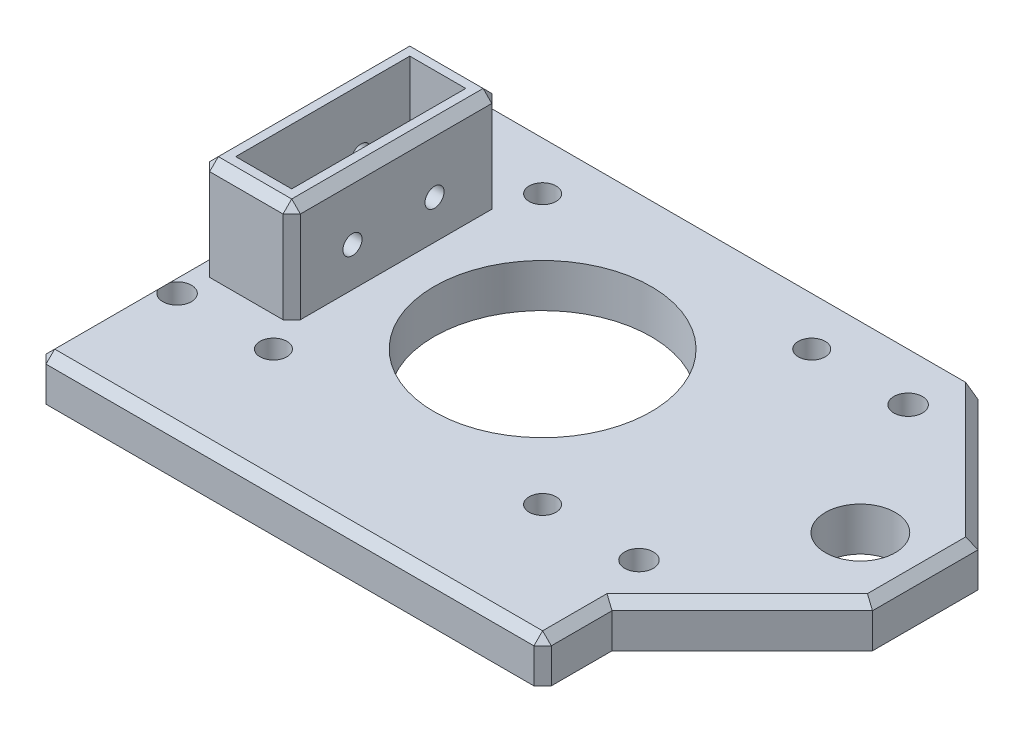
ISO-10303-21;
HEADER;
FILE_DESCRIPTION(('STEP AP214'),'2;1');
FILE_NAME('part.step','',(''),(''),'','','');
FILE_SCHEMA(('AUTOMOTIVE_DESIGN { 1 0 10303 214 1 1 1 1 }'));
ENDSEC;
DATA;
#1=APPLICATION_CONTEXT('core data for automotive mechanical design processes');
#2=APPLICATION_PROTOCOL_DEFINITION('international standard','automotive_design',2000,#1);
#3=PRODUCT_CONTEXT('',#1,'mechanical');
#4=PRODUCT('Part','Part','',(#3));
#5=PRODUCT_RELATED_PRODUCT_CATEGORY('part','',(#4));
#6=PRODUCT_DEFINITION_FORMATION('','',#4);
#7=PRODUCT_DEFINITION_CONTEXT('part definition',#1,'design');
#8=PRODUCT_DEFINITION('design','',#6,#7);
#9=PRODUCT_DEFINITION_SHAPE('','',#8);
#10=(LENGTH_UNIT() NAMED_UNIT(*) SI_UNIT(.MILLI.,.METRE.));
#11=(NAMED_UNIT(*) PLANE_ANGLE_UNIT() SI_UNIT($,.RADIAN.));
#12=(NAMED_UNIT(*) SI_UNIT($,.STERADIAN.) SOLID_ANGLE_UNIT());
#13=UNCERTAINTY_MEASURE_WITH_UNIT(LENGTH_MEASURE(1.E-05),#10,'distance_accuracy_value','');
#14=(GEOMETRIC_REPRESENTATION_CONTEXT(3) GLOBAL_UNCERTAINTY_ASSIGNED_CONTEXT((#13)) GLOBAL_UNIT_ASSIGNED_CONTEXT((#10,
#11,#12)) REPRESENTATION_CONTEXT('',''));
#15=CARTESIAN_POINT('',(0.,0.,0.));
#16=DIRECTION('',(0.,0.,1.));
#17=DIRECTION('',(1.,0.,0.));
#18=AXIS2_PLACEMENT_3D('',#15,#16,#17);
#19=CARTESIAN_POINT('',(0.,12.1618753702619,0.));
#20=DIRECTION('',(0.,1.,0.));
#21=DIRECTION('',(-1.,0.,0.));
#22=AXIS2_PLACEMENT_3D('',#19,#20,#21);
#23=PLANE('',#22);
#24=DIRECTION('',(-1.,0.,0.));
#25=VECTOR('',#24,1.);
#26=CARTESIAN_POINT('',(-21.5792355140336,12.1618753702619,1011.07500000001));
#27=LINE('',#26,#25);
#28=CARTESIAN_POINT('',(-21.5792355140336,12.1618753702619,1011.07500000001));
#29=VERTEX_POINT('',#28);
#30=CARTESIAN_POINT('',(-28.0292355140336,12.1618753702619,1011.07500000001));
#31=VERTEX_POINT('',#30);
#32=EDGE_CURVE('E323',#29,#31,#27,.T.);
#33=ORIENTED_EDGE('',*,*,#32,.T.);
#34=DIRECTION('',(0.,0.,1.));
#35=VECTOR('',#34,1.);
#36=CARTESIAN_POINT('',(-28.0292355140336,12.1618753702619,1011.07500000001));
#37=LINE('',#36,#35);
#38=CARTESIAN_POINT('',(-28.0292355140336,12.1618753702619,1031.12500000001));
#39=VERTEX_POINT('',#38);
#40=EDGE_CURVE('E321',#31,#39,#37,.T.);
#41=ORIENTED_EDGE('',*,*,#40,.T.);
#42=DIRECTION('',(1.,0.,0.));
#43=VECTOR('',#42,1.);
#44=CARTESIAN_POINT('',(-28.0292355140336,12.1618753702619,1031.12500000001));
#45=LINE('',#44,#43);
#46=CARTESIAN_POINT('',(-21.5792355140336,12.1618753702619,1031.12500000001));
#47=VERTEX_POINT('',#46);
#48=EDGE_CURVE('E328',#39,#47,#45,.T.);
#49=ORIENTED_EDGE('',*,*,#48,.T.);
#50=DIRECTION('',(0.,0.,-1.));
#51=VECTOR('',#50,1.);
#52=CARTESIAN_POINT('',(-21.5792355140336,12.1618753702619,1031.12500000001));
#53=LINE('',#52,#51);
#54=EDGE_CURVE('E335',#47,#29,#53,.T.);
#55=ORIENTED_EDGE('',*,*,#54,.T.);
#56=EDGE_LOOP('',(#33,#41,#49,#55));
#57=FACE_BOUND('',#56,.T.);
#58=DIRECTION('',(1.,0.,0.));
#59=VECTOR('',#58,1.);
#60=CARTESIAN_POINT('',(-22.2792355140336,12.1618753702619,1011.77500000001));
#61=LINE('',#60,#59);
#62=CARTESIAN_POINT('',(-27.3292355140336,12.1618753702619,1011.77500000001));
#63=VERTEX_POINT('',#62);
#64=CARTESIAN_POINT('',(-22.2792355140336,12.1618753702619,1011.77500000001));
#65=VERTEX_POINT('',#64);
#66=EDGE_CURVE('E264',#63,#65,#61,.T.);
#67=ORIENTED_EDGE('',*,*,#66,.T.);
#68=DIRECTION('',(0.,0.,1.));
#69=VECTOR('',#68,1.);
#70=CARTESIAN_POINT('',(-22.2792355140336,12.1618753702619,1030.42500000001));
#71=LINE('',#70,#69);
#72=CARTESIAN_POINT('',(-22.2792355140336,12.1618753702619,1030.42500000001));
#73=VERTEX_POINT('',#72);
#74=EDGE_CURVE('E291',#65,#73,#71,.T.);
#75=ORIENTED_EDGE('',*,*,#74,.T.);
#76=DIRECTION('',(-1.,0.,0.));
#77=VECTOR('',#76,1.);
#78=CARTESIAN_POINT('',(-27.3292355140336,12.1618753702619,1030.42500000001));
#79=LINE('',#78,#77);
#80=CARTESIAN_POINT('',(-27.3292355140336,12.1618753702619,1030.42500000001));
#81=VERTEX_POINT('',#80);
#82=EDGE_CURVE('E286',#73,#81,#79,.T.);
#83=ORIENTED_EDGE('',*,*,#82,.T.);
#84=DIRECTION('',(0.,0.,-1.));
#85=VECTOR('',#84,1.);
#86=CARTESIAN_POINT('',(-27.3292355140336,12.1618753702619,1011.77500000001));
#87=LINE('',#86,#85);
#88=EDGE_CURVE('E280',#81,#63,#87,.T.);
#89=ORIENTED_EDGE('',*,*,#88,.T.);
#90=EDGE_LOOP('',(#67,#75,#83,#89));
#91=FACE_BOUND('',#90,.T.);
#92=ADVANCED_FACE('F50',(#57,#91),#23,.T.);
#93=CARTESIAN_POINT('',(0.,15.1618753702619,0.));
#94=DIRECTION('',(0.,-1.,0.));
#95=DIRECTION('',(1.,0.,0.));
#96=AXIS2_PLACEMENT_3D('',#93,#94,#95);
#97=PLANE('',#96);
#98=CARTESIAN_POINT('',(12.7957644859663,15.1618753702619,1005.60000000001));
#99=DIRECTION('',(0.,1.,0.));
#100=DIRECTION('',(-1.,0.,0.));
#101=AXIS2_PLACEMENT_3D('',#98,#99,#100);
#102=CIRCLE('',#101,1.55000000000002);
#103=CARTESIAN_POINT('',(11.2457644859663,15.1618753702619,1005.60000000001));
#104=VERTEX_POINT('',#103);
#105=EDGE_CURVE('E394',#104,#104,#102,.T.);
#106=ORIENTED_EDGE('',*,*,#105,.F.);
#107=EDGE_LOOP('',(#106));
#108=FACE_BOUND('',#107,.T.);
#109=CARTESIAN_POINT('',(-18.2042355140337,15.1618753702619,1036.60000000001));
#110=DIRECTION('',(0.,1.,0.));
#111=DIRECTION('',(-1.,0.,0.));
#112=AXIS2_PLACEMENT_3D('',#109,#110,#111);
#113=CIRCLE('',#112,1.55000000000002);
#114=CARTESIAN_POINT('',(-19.7542355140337,15.1618753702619,1036.60000000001));
#115=VERTEX_POINT('',#114);
#116=EDGE_CURVE('E385',#115,#115,#113,.T.);
#117=ORIENTED_EDGE('',*,*,#116,.F.);
#118=EDGE_LOOP('',(#117));
#119=FACE_BOUND('',#118,.T.);
#120=CARTESIAN_POINT('',(12.7957644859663,15.1618753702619,1036.60000000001));
#121=DIRECTION('',(0.,1.,0.));
#122=DIRECTION('',(-1.,0.,0.));
#123=AXIS2_PLACEMENT_3D('',#120,#121,#122);
#124=CIRCLE('',#123,1.55000000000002);
#125=CARTESIAN_POINT('',(11.2457644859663,15.1618753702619,1036.60000000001));
#126=VERTEX_POINT('',#125);
#127=EDGE_CURVE('E380',#126,#126,#124,.T.);
#128=ORIENTED_EDGE('',*,*,#127,.F.);
#129=EDGE_LOOP('',(#128));
#130=FACE_BOUND('',#129,.T.);
#131=CARTESIAN_POINT('',(-18.2042355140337,15.1618753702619,1005.60000000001));
#132=DIRECTION('',(0.,1.,0.));
#133=DIRECTION('',(-1.,0.,0.));
#134=AXIS2_PLACEMENT_3D('',#131,#132,#133);
#135=CIRCLE('',#134,1.55000000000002);
#136=CARTESIAN_POINT('',(-19.7542355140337,15.1618753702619,1005.60000000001));
#137=VERTEX_POINT('',#136);
#138=EDGE_CURVE('E405',#137,#137,#135,.T.);
#139=ORIENTED_EDGE('',*,*,#138,.F.);
#140=EDGE_LOOP('',(#139));
#141=FACE_BOUND('',#140,.T.);
#142=CARTESIAN_POINT('',(23.8957644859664,15.1618753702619,1005.60000000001));
#143=DIRECTION('',(0.,1.,0.));
#144=DIRECTION('',(-1.,0.,0.));
#145=AXIS2_PLACEMENT_3D('',#142,#143,#144);
#146=CIRCLE('',#145,1.65);
#147=CARTESIAN_POINT('',(22.2457644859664,15.1618753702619,1005.60000000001));
#148=VERTEX_POINT('',#147);
#149=EDGE_CURVE('E449',#148,#148,#146,.T.);
#150=ORIENTED_EDGE('',*,*,#149,.F.);
#151=EDGE_LOOP('',(#150));
#152=FACE_BOUND('',#151,.T.);
#153=CARTESIAN_POINT('',(23.8957644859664,15.1618753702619,1036.60000000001));
#154=DIRECTION('',(0.,1.,0.));
#155=DIRECTION('',(-1.,0.,0.));
#156=AXIS2_PLACEMENT_3D('',#153,#154,#155);
#157=CIRCLE('',#156,1.65);
#158=CARTESIAN_POINT('',(22.2457644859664,15.1618753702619,1036.60000000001));
#159=VERTEX_POINT('',#158);
#160=EDGE_CURVE('E436',#159,#159,#157,.T.);
#161=ORIENTED_EDGE('',*,*,#160,.F.);
#162=EDGE_LOOP('',(#161));
#163=FACE_BOUND('',#162,.T.);
#164=DIRECTION('',(-1.,0.,0.));
#165=VECTOR('',#164,1.);
#166=CARTESIAN_POINT('',(26.3957644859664,15.1618753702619,1000.05000000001));
#167=LINE('',#166,#165);
#168=CARTESIAN_POINT('',(24.9815509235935,15.1618753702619,1000.05000000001));
#169=VERTEX_POINT('',#168);
#170=CARTESIAN_POINT('',(-30.8042355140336,15.1618753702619,1000.05000000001));
#171=VERTEX_POINT('',#170);
#172=EDGE_CURVE('E483',#169,#171,#167,.T.);
#173=ORIENTED_EDGE('',*,*,#172,.T.);
#174=DIRECTION('',(0.,0.,1.));
#175=VECTOR('',#174,1.);
#176=CARTESIAN_POINT('',(-30.8042355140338,15.1618753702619,0.));
#177=LINE('',#176,#175);
#178=CARTESIAN_POINT('',(-30.8042355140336,15.1618753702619,1004.91261364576));
#179=VERTEX_POINT('',#178);
#180=EDGE_CURVE('E527',#171,#179,#177,.T.);
#181=ORIENTED_EDGE('',*,*,#180,.T.);
#182=CARTESIAN_POINT('',(-29.3042355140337,15.1618753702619,1005.60000000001));
#183=DIRECTION('',(0.,1.,0.));
#184=DIRECTION('',(-1.,0.,0.));
#185=AXIS2_PLACEMENT_3D('',#182,#183,#184);
#186=CIRCLE('',#185,1.65);
#187=CARTESIAN_POINT('',(-30.8042355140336,15.1618753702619,1006.28738635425));
#188=VERTEX_POINT('',#187);
#189=EDGE_CURVE('E466',#188,#179,#186,.T.);
#190=ORIENTED_EDGE('',*,*,#189,.F.);
#191=DIRECTION('',(0.,0.,1.));
#192=VECTOR('',#191,1.);
#193=CARTESIAN_POINT('',(-30.8042355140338,15.1618753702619,0.));
#194=LINE('',#193,#192);
#195=CARTESIAN_POINT('',(-30.8042355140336,15.1618753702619,1035.91261364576));
#196=VERTEX_POINT('',#195);
#197=EDGE_CURVE('E526',#188,#196,#194,.T.);
#198=ORIENTED_EDGE('',*,*,#197,.T.);
#199=CARTESIAN_POINT('',(-29.3042355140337,15.1618753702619,1036.60000000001));
#200=DIRECTION('',(0.,1.,0.));
#201=DIRECTION('',(-1.,0.,0.));
#202=AXIS2_PLACEMENT_3D('',#199,#200,#201);
#203=CIRCLE('',#202,1.65);
#204=CARTESIAN_POINT('',(-30.8042355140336,15.1618753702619,1037.28738635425));
#205=VERTEX_POINT('',#204);
#206=EDGE_CURVE('E456',#205,#196,#203,.T.);
#207=ORIENTED_EDGE('',*,*,#206,.F.);
#208=DIRECTION('',(0.,0.,1.));
#209=VECTOR('',#208,1.);
#210=CARTESIAN_POINT('',(-30.8042355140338,15.1618753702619,0.));
#211=LINE('',#210,#209);
#212=CARTESIAN_POINT('',(-30.8042355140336,15.1618753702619,1049.20000000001));
#213=VERTEX_POINT('',#212);
#214=EDGE_CURVE('E512',#205,#213,#211,.T.);
#215=ORIENTED_EDGE('',*,*,#214,.T.);
#216=DIRECTION('',(1.,0.,0.));
#217=VECTOR('',#216,1.);
#218=CARTESIAN_POINT('',(0.,15.1618753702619,1049.20000000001));
#219=LINE('',#218,#217);
#220=CARTESIAN_POINT('',(25.3957644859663,15.1618753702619,1049.20000000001));
#221=VERTEX_POINT('',#220);
#222=EDGE_CURVE('E507',#213,#221,#219,.T.);
#223=ORIENTED_EDGE('',*,*,#222,.T.);
#224=DIRECTION('',(0.,0.,-1.));
#225=VECTOR('',#224,1.);
#226=CARTESIAN_POINT('',(25.3957644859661,15.1618753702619,0.));
#227=LINE('',#226,#225);
#228=CARTESIAN_POINT('',(25.3957644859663,15.1618753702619,1041.78578643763));
#229=VERTEX_POINT('',#228);
#230=EDGE_CURVE('E511',#221,#229,#227,.T.);
#231=ORIENTED_EDGE('',*,*,#230,.T.);
#232=DIRECTION('',(0.70710678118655,0.,-0.707106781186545));
#233=VECTOR('',#232,1.);
#234=CARTESIAN_POINT('',(40.6886577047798,15.1618753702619,1026.49289321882));
#235=LINE('',#234,#233);
#236=CARTESIAN_POINT('',(40.3957644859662,15.1618753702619,1026.78578643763));
#237=VERTEX_POINT('',#236);
#238=EDGE_CURVE('E519',#229,#237,#235,.T.);
#239=ORIENTED_EDGE('',*,*,#238,.T.);
#240=DIRECTION('',(0.,0.,-1.));
#241=VECTOR('',#240,1.);
#242=CARTESIAN_POINT('',(40.3957644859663,15.1618753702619,1015.05000000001));
#243=LINE('',#242,#241);
#244=CARTESIAN_POINT('',(40.3957644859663,15.1618753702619,1015.46421356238));
#245=VERTEX_POINT('',#244);
#246=EDGE_CURVE('E516',#237,#245,#243,.T.);
#247=ORIENTED_EDGE('',*,*,#246,.T.);
#248=DIRECTION('',(-0.70710678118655,0.,-0.707106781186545));
#249=VECTOR('',#248,1.);
#250=CARTESIAN_POINT('',(25.6886577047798,15.1618753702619,1000.75710678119));
#251=LINE('',#250,#249);
#252=EDGE_CURVE('E525',#245,#169,#251,.T.);
#253=ORIENTED_EDGE('',*,*,#252,.T.);
#254=EDGE_LOOP('',(#173,#181,#190,#198,#207,#215,#223,#231,#239,#247,#253));
#255=FACE_BOUND('',#254,.T.);
#256=CARTESIAN_POINT('',(-2.70423551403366,15.1618753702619,1021.10000000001));
#257=DIRECTION('',(0.,1.,0.));
#258=DIRECTION('',(-1.,0.,0.));
#259=AXIS2_PLACEMENT_3D('',#256,#257,#258);
#260=CIRCLE('',#259,12.5);
#261=CARTESIAN_POINT('',(-15.2042355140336,15.1618753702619,1021.10000000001));
#262=VERTEX_POINT('',#261);
#263=EDGE_CURVE('E479',#262,#262,#260,.T.);
#264=ORIENTED_EDGE('',*,*,#263,.F.);
#265=EDGE_LOOP('',(#264));
#266=FACE_BOUND('',#265,.T.);
#267=CARTESIAN_POINT('',(33.8957644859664,15.1618753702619,1021.10000000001));
#268=DIRECTION('',(0.,1.,0.));
#269=DIRECTION('',(-1.,0.,0.));
#270=AXIS2_PLACEMENT_3D('',#267,#268,#269);
#271=CIRCLE('',#270,4.02499999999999);
#272=CARTESIAN_POINT('',(29.8707644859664,15.1618753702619,1021.10000000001));
#273=VERTEX_POINT('',#272);
#274=EDGE_CURVE('E412',#273,#273,#271,.T.);
#275=ORIENTED_EDGE('',*,*,#274,.F.);
#276=EDGE_LOOP('',(#275));
#277=FACE_BOUND('',#276,.T.);
#278=DIRECTION('',(0.,0.,-1.));
#279=VECTOR('',#278,1.);
#280=CARTESIAN_POINT('',(-19.5792355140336,15.1618753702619,1033.12500000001));
#281=LINE('',#280,#279);
#282=CARTESIAN_POINT('',(-19.5792355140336,15.1618753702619,1032.12500000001));
#283=VERTEX_POINT('',#282);
#284=CARTESIAN_POINT('',(-19.5792355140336,15.1618753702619,1010.07500000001));
#285=VERTEX_POINT('',#284);
#286=EDGE_CURVE('E365',#283,#285,#281,.T.);
#287=ORIENTED_EDGE('',*,*,#286,.F.);
#288=DIRECTION('',(0.707106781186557,0.,-0.707106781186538));
#289=VECTOR('',#288,1.);
#290=CARTESIAN_POINT('',(506.272882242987,15.1618753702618,506.272882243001));
#291=LINE('',#290,#289);
#292=CARTESIAN_POINT('',(-20.5792355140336,15.1618753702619,1033.12500000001));
#293=VERTEX_POINT('',#292);
#294=EDGE_CURVE('E59',#283,#293,#291,.F.);
#295=ORIENTED_EDGE('',*,*,#294,.T.);
#296=DIRECTION('',(1.,0.,0.));
#297=VECTOR('',#296,1.);
#298=CARTESIAN_POINT('',(-30.0292355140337,15.1618753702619,1033.12500000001));
#299=LINE('',#298,#297);
#300=CARTESIAN_POINT('',(-29.0292355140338,15.1618753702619,1033.12500000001));
#301=VERTEX_POINT('',#300);
#302=EDGE_CURVE('E372',#301,#293,#299,.T.);
#303=ORIENTED_EDGE('',*,*,#302,.F.);
#304=DIRECTION('',(0.707106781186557,0.,0.707106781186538));
#305=VECTOR('',#304,1.);
#306=CARTESIAN_POINT('',(-531.07711775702,15.161875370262,531.077117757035));
#307=LINE('',#306,#305);
#308=CARTESIAN_POINT('',(-30.0292355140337,15.1618753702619,1032.12500000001));
#309=VERTEX_POINT('',#308);
#310=EDGE_CURVE('E11',#301,#309,#307,.F.);
#311=ORIENTED_EDGE('',*,*,#310,.T.);
#312=DIRECTION('',(0.,0.,1.));
#313=VECTOR('',#312,1.);
#314=CARTESIAN_POINT('',(-30.0292355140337,15.1618753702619,1033.12500000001));
#315=LINE('',#314,#313);
#316=CARTESIAN_POINT('',(-30.0292355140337,15.1618753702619,1010.07500000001));
#317=VERTEX_POINT('',#316);
#318=EDGE_CURVE('E369',#317,#309,#315,.T.);
#319=ORIENTED_EDGE('',*,*,#318,.F.);
#320=DIRECTION('',(-0.707106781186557,0.,0.707106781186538));
#321=VECTOR('',#320,1.);
#322=CARTESIAN_POINT('',(490.022882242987,15.1618753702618,490.022882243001));
#323=LINE('',#322,#321);
#324=CARTESIAN_POINT('',(-29.0292355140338,15.1618753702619,1009.07500000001));
#325=VERTEX_POINT('',#324);
#326=EDGE_CURVE('E676',#317,#325,#323,.F.);
#327=ORIENTED_EDGE('',*,*,#326,.T.);
#328=DIRECTION('',(-1.,0.,0.));
#329=VECTOR('',#328,1.);
#330=CARTESIAN_POINT('',(-30.0292355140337,15.1618753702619,1009.07500000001));
#331=LINE('',#330,#329);
#332=CARTESIAN_POINT('',(-20.5792355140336,15.1618753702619,1009.07500000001));
#333=VERTEX_POINT('',#332);
#334=EDGE_CURVE('E366',#333,#325,#331,.T.);
#335=ORIENTED_EDGE('',*,*,#334,.F.);
#336=DIRECTION('',(-0.707106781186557,0.,-0.707106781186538));
#337=VECTOR('',#336,1.);
#338=CARTESIAN_POINT('',(-514.82711775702,15.1618753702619,514.827117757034));
#339=LINE('',#338,#337);
#340=EDGE_CURVE('E673',#333,#285,#339,.F.);
#341=ORIENTED_EDGE('',*,*,#340,.T.);
#342=EDGE_LOOP('',(#287,#295,#303,#311,#319,#327,#335,#341));
#343=FACE_BOUND('',#342,.T.);
#344=ADVANCED_FACE('F792',(#108,#119,#130,#141,#152,#163,#255,#266,#277,#343),#97,.F.);
#345=CARTESIAN_POINT('',(0.,10.1618753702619,0.));
#346=DIRECTION('',(0.,-1.,0.));
#347=DIRECTION('',(1.,0.,0.));
#348=AXIS2_PLACEMENT_3D('',#345,#346,#347);
#349=PLANE('',#348);
#350=DIRECTION('',(0.,0.,-1.));
#351=VECTOR('',#350,1.);
#352=CARTESIAN_POINT('',(-22.2792355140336,10.1618753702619,1030.42500000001));
#353=LINE('',#352,#351);
#354=CARTESIAN_POINT('',(-22.2792355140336,10.1618753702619,1030.42500000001));
#355=VERTEX_POINT('',#354);
#356=CARTESIAN_POINT('',(-22.2792355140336,10.1618753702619,1011.77500000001));
#357=VERTEX_POINT('',#356);
#358=EDGE_CURVE('E308',#355,#357,#353,.T.);
#359=ORIENTED_EDGE('',*,*,#358,.T.);
#360=DIRECTION('',(-1.,0.,0.));
#361=VECTOR('',#360,1.);
#362=CARTESIAN_POINT('',(-22.2792355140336,10.1618753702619,1011.77500000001));
#363=LINE('',#362,#361);
#364=CARTESIAN_POINT('',(-27.3292355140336,10.1618753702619,1011.77500000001));
#365=VERTEX_POINT('',#364);
#366=EDGE_CURVE('E275',#357,#365,#363,.T.);
#367=ORIENTED_EDGE('',*,*,#366,.T.);
#368=DIRECTION('',(0.,0.,1.));
#369=VECTOR('',#368,1.);
#370=CARTESIAN_POINT('',(-27.3292355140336,10.1618753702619,1011.77500000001));
#371=LINE('',#370,#369);
#372=CARTESIAN_POINT('',(-27.3292355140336,10.1618753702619,1030.42500000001));
#373=VERTEX_POINT('',#372);
#374=EDGE_CURVE('E281',#365,#373,#371,.T.);
#375=ORIENTED_EDGE('',*,*,#374,.T.);
#376=DIRECTION('',(1.,0.,0.));
#377=VECTOR('',#376,1.);
#378=CARTESIAN_POINT('',(-27.3292355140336,10.1618753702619,1030.42500000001));
#379=LINE('',#378,#377);
#380=EDGE_CURVE('E302',#373,#355,#379,.T.);
#381=ORIENTED_EDGE('',*,*,#380,.T.);
#382=EDGE_LOOP('',(#359,#367,#375,#381));
#383=FACE_BOUND('',#382,.T.);
#384=CARTESIAN_POINT('',(12.7957644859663,10.1618753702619,1005.60000000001));
#385=DIRECTION('',(0.,-1.,0.));
#386=DIRECTION('',(1.,0.,0.));
#387=AXIS2_PLACEMENT_3D('',#384,#385,#386);
#388=CIRCLE('',#387,1.55000000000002);
#389=CARTESIAN_POINT('',(14.3457644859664,10.1618753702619,1005.60000000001));
#390=VERTEX_POINT('',#389);
#391=EDGE_CURVE('E388',#390,#390,#388,.F.);
#392=ORIENTED_EDGE('',*,*,#391,.T.);
#393=EDGE_LOOP('',(#392));
#394=FACE_BOUND('',#393,.T.);
#395=CARTESIAN_POINT('',(-18.2042355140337,10.1618753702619,1036.60000000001));
#396=DIRECTION('',(0.,-1.,0.));
#397=DIRECTION('',(1.,0.,0.));
#398=AXIS2_PLACEMENT_3D('',#395,#396,#397);
#399=CIRCLE('',#398,1.55000000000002);
#400=CARTESIAN_POINT('',(-16.6542355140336,10.1618753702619,1036.60000000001));
#401=VERTEX_POINT('',#400);
#402=EDGE_CURVE('E392',#401,#401,#399,.F.);
#403=ORIENTED_EDGE('',*,*,#402,.T.);
#404=EDGE_LOOP('',(#403));
#405=FACE_BOUND('',#404,.T.);
#406=CARTESIAN_POINT('',(12.7957644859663,10.1618753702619,1036.60000000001));
#407=DIRECTION('',(0.,-1.,0.));
#408=DIRECTION('',(1.,0.,0.));
#409=AXIS2_PLACEMENT_3D('',#406,#407,#408);
#410=CIRCLE('',#409,1.55000000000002);
#411=CARTESIAN_POINT('',(14.3457644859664,10.1618753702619,1036.60000000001));
#412=VERTEX_POINT('',#411);
#413=EDGE_CURVE('E377',#412,#412,#410,.F.);
#414=ORIENTED_EDGE('',*,*,#413,.T.);
#415=EDGE_LOOP('',(#414));
#416=FACE_BOUND('',#415,.T.);
#417=CARTESIAN_POINT('',(-18.2042355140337,10.1618753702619,1005.60000000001));
#418=DIRECTION('',(0.,-1.,0.));
#419=DIRECTION('',(1.,0.,0.));
#420=AXIS2_PLACEMENT_3D('',#417,#418,#419);
#421=CIRCLE('',#420,1.55000000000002);
#422=CARTESIAN_POINT('',(-16.6542355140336,10.1618753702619,1005.60000000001));
#423=VERTEX_POINT('',#422);
#424=EDGE_CURVE('E386',#423,#423,#421,.F.);
#425=ORIENTED_EDGE('',*,*,#424,.T.);
#426=EDGE_LOOP('',(#425));
#427=FACE_BOUND('',#426,.T.);
#428=CARTESIAN_POINT('',(-29.3042355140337,10.1618753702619,1036.60000000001));
#429=DIRECTION('',(0.,-1.,0.));
#430=DIRECTION('',(1.,0.,0.));
#431=AXIS2_PLACEMENT_3D('',#428,#429,#430);
#432=CIRCLE('',#431,1.65);
#433=CARTESIAN_POINT('',(-27.6542355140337,10.1618753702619,1036.60000000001));
#434=VERTEX_POINT('',#433);
#435=EDGE_CURVE('E454',#434,#434,#432,.F.);
#436=ORIENTED_EDGE('',*,*,#435,.T.);
#437=EDGE_LOOP('',(#436));
#438=FACE_BOUND('',#437,.T.);
#439=CARTESIAN_POINT('',(23.8957644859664,10.1618753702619,1005.60000000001));
#440=DIRECTION('',(0.,-1.,0.));
#441=DIRECTION('',(1.,0.,0.));
#442=AXIS2_PLACEMENT_3D('',#439,#440,#441);
#443=CIRCLE('',#442,1.65);
#444=CARTESIAN_POINT('',(25.5457644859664,10.1618753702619,1005.60000000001));
#445=VERTEX_POINT('',#444);
#446=EDGE_CURVE('E464',#445,#445,#443,.F.);
#447=ORIENTED_EDGE('',*,*,#446,.T.);
#448=EDGE_LOOP('',(#447));
#449=FACE_BOUND('',#448,.T.);
#450=CARTESIAN_POINT('',(23.8957644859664,10.1618753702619,1036.60000000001));
#451=DIRECTION('',(0.,-1.,0.));
#452=DIRECTION('',(1.,0.,0.));
#453=AXIS2_PLACEMENT_3D('',#450,#451,#452);
#454=CIRCLE('',#453,1.65);
#455=CARTESIAN_POINT('',(25.5457644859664,10.1618753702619,1036.60000000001));
#456=VERTEX_POINT('',#455);
#457=EDGE_CURVE('E443',#456,#456,#454,.F.);
#458=ORIENTED_EDGE('',*,*,#457,.T.);
#459=EDGE_LOOP('',(#458));
#460=FACE_BOUND('',#459,.T.);
#461=CARTESIAN_POINT('',(-29.3042355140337,10.1618753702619,1005.60000000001));
#462=DIRECTION('',(0.,-1.,0.));
#463=DIRECTION('',(1.,0.,0.));
#464=AXIS2_PLACEMENT_3D('',#461,#462,#463);
#465=CIRCLE('',#464,1.65);
#466=CARTESIAN_POINT('',(-27.6542355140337,10.1618753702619,1005.60000000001));
#467=VERTEX_POINT('',#466);
#468=EDGE_CURVE('E459',#467,#467,#465,.F.);
#469=ORIENTED_EDGE('',*,*,#468,.T.);
#470=EDGE_LOOP('',(#469));
#471=FACE_BOUND('',#470,.T.);
#472=DIRECTION('',(1.,0.,0.));
#473=VECTOR('',#472,1.);
#474=CARTESIAN_POINT('',(26.3957644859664,10.1618753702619,1050.20000000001));
#475=LINE('',#474,#473);
#476=CARTESIAN_POINT('',(-30.8042355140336,10.1618753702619,1050.20000000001));
#477=VERTEX_POINT('',#476);
#478=CARTESIAN_POINT('',(25.3957644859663,10.1618753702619,1050.20000000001));
#479=VERTEX_POINT('',#478);
#480=EDGE_CURVE('E490',#477,#479,#475,.T.);
#481=ORIENTED_EDGE('',*,*,#480,.F.);
#482=DIRECTION('',(0.707106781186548,0.,0.707106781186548));
#483=VECTOR('',#482,1.);
#484=CARTESIAN_POINT('',(-540.50211775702,10.161875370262,540.50211775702));
#485=LINE('',#484,#483);
#486=CARTESIAN_POINT('',(-31.8042355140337,10.1618753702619,1049.20000000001));
#487=VERTEX_POINT('',#486);
#488=EDGE_CURVE('E566',#477,#487,#485,.F.);
#489=ORIENTED_EDGE('',*,*,#488,.T.);
#490=DIRECTION('',(0.,0.,1.));
#491=VECTOR('',#490,1.);
#492=CARTESIAN_POINT('',(-31.8042355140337,10.1618753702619,1000.05000000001));
#493=LINE('',#492,#491);
#494=CARTESIAN_POINT('',(-31.8042355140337,10.1618753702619,1000.05000000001));
#495=VERTEX_POINT('',#494);
#496=EDGE_CURVE('E496',#495,#487,#493,.T.);
#497=ORIENTED_EDGE('',*,*,#496,.F.);
#498=DIRECTION('',(-1.,0.,0.));
#499=VECTOR('',#498,1.);
#500=CARTESIAN_POINT('',(26.3957644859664,10.1618753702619,1000.05000000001));
#501=LINE('',#500,#499);
#502=CARTESIAN_POINT('',(26.3957644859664,10.1618753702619,1000.05000000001));
#503=VERTEX_POINT('',#502);
#504=EDGE_CURVE('E495',#503,#495,#501,.T.);
#505=ORIENTED_EDGE('',*,*,#504,.F.);
#506=DIRECTION('',(-0.70710678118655,0.,-0.707106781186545));
#507=VECTOR('',#506,1.);
#508=CARTESIAN_POINT('',(41.3957644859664,10.1618753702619,1015.05000000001));
#509=LINE('',#508,#507);
#510=CARTESIAN_POINT('',(41.3957644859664,10.1618753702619,1015.05000000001));
#511=VERTEX_POINT('',#510);
#512=EDGE_CURVE('E413',#511,#503,#509,.T.);
#513=ORIENTED_EDGE('',*,*,#512,.F.);
#514=DIRECTION('',(0.,0.,-1.));
#515=VECTOR('',#514,1.);
#516=CARTESIAN_POINT('',(41.3957644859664,10.1618753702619,1027.20000000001));
#517=LINE('',#516,#515);
#518=CARTESIAN_POINT('',(41.3957644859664,10.1618753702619,1027.20000000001));
#519=VERTEX_POINT('',#518);
#520=EDGE_CURVE('E430',#519,#511,#517,.T.);
#521=ORIENTED_EDGE('',*,*,#520,.F.);
#522=DIRECTION('',(0.70710678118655,0.,-0.707106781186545));
#523=VECTOR('',#522,1.);
#524=CARTESIAN_POINT('',(26.3957644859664,10.1618753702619,1042.20000000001));
#525=LINE('',#524,#523);
#526=CARTESIAN_POINT('',(26.3957644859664,10.1618753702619,1042.20000000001));
#527=VERTEX_POINT('',#526);
#528=EDGE_CURVE('E421',#527,#519,#525,.T.);
#529=ORIENTED_EDGE('',*,*,#528,.F.);
#530=DIRECTION('',(0.,0.,-1.));
#531=VECTOR('',#530,1.);
#532=CARTESIAN_POINT('',(26.3957644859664,10.1618753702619,1000.05000000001));
#533=LINE('',#532,#531);
#534=CARTESIAN_POINT('',(26.3957644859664,10.1618753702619,1049.20000000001));
#535=VERTEX_POINT('',#534);
#536=EDGE_CURVE('E477',#535,#527,#533,.T.);
#537=ORIENTED_EDGE('',*,*,#536,.F.);
#538=DIRECTION('',(0.707106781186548,0.,-0.707106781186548));
#539=VECTOR('',#538,1.);
#540=CARTESIAN_POINT('',(537.797882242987,10.1618753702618,537.797882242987));
#541=LINE('',#540,#539);
#542=EDGE_CURVE('E563',#535,#479,#541,.F.);
#543=ORIENTED_EDGE('',*,*,#542,.T.);
#544=EDGE_LOOP('',(#481,#489,#497,#505,#513,#521,#529,#537,#543));
#545=FACE_BOUND('',#544,.T.);
#546=CARTESIAN_POINT('',(-2.70423551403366,10.1618753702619,1021.10000000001));
#547=DIRECTION('',(0.,1.,0.));
#548=DIRECTION('',(-1.,0.,0.));
#549=AXIS2_PLACEMENT_3D('',#546,#547,#548);
#550=CIRCLE('',#549,12.5);
#551=CARTESIAN_POINT('',(-15.2042355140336,10.1618753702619,1021.10000000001));
#552=VERTEX_POINT('',#551);
#553=EDGE_CURVE('E474',#552,#552,#550,.T.);
#554=ORIENTED_EDGE('',*,*,#553,.T.);
#555=EDGE_LOOP('',(#554));
#556=FACE_BOUND('',#555,.T.);
#557=CARTESIAN_POINT('',(33.8957644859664,10.1618753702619,1021.10000000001));
#558=DIRECTION('',(0.,1.,0.));
#559=DIRECTION('',(-1.,0.,0.));
#560=AXIS2_PLACEMENT_3D('',#557,#558,#559);
#561=CIRCLE('',#560,4.02499999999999);
#562=CARTESIAN_POINT('',(29.8707644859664,10.1618753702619,1021.10000000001));
#563=VERTEX_POINT('',#562);
#564=EDGE_CURVE('E406',#563,#563,#561,.T.);
#565=ORIENTED_EDGE('',*,*,#564,.T.);
#566=EDGE_LOOP('',(#565));
#567=FACE_BOUND('',#566,.T.);
#568=ADVANCED_FACE('F799',(#383,#394,#405,#416,#427,#438,#449,#460,#471,#545,#556,#567),#349,.T.);
#569=CARTESIAN_POINT('',(26.3957644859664,15.1618753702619,1000.05000000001));
#570=DIRECTION('',(-1.,0.,0.));
#571=DIRECTION('',(0.,0.,1.));
#572=AXIS2_PLACEMENT_3D('',#569,#570,#571);
#573=PLANE('',#572);
#574=DIRECTION('',(0.,1.,0.));
#575=VECTOR('',#574,1.);
#576=CARTESIAN_POINT('',(26.3957644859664,10.1618753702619,1042.20000000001));
#577=LINE('',#576,#575);
#578=CARTESIAN_POINT('',(26.3957644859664,14.1618753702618,1042.20000000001));
#579=VERTEX_POINT('',#578);
#580=EDGE_CURVE('E431',#527,#579,#577,.T.);
#581=ORIENTED_EDGE('',*,*,#580,.T.);
#582=DIRECTION('',(0.,0.,1.));
#583=VECTOR('',#582,1.);
#584=CARTESIAN_POINT('',(26.3957644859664,14.1618753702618,1000.05000000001));
#585=LINE('',#584,#583);
#586=CARTESIAN_POINT('',(26.3957644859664,14.1618753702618,1049.20000000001));
#587=VERTEX_POINT('',#586);
#588=EDGE_CURVE('E553',#579,#587,#585,.T.);
#589=ORIENTED_EDGE('',*,*,#588,.T.);
#590=DIRECTION('',(0.,-1.,0.));
#591=VECTOR('',#590,1.);
#592=CARTESIAN_POINT('',(26.3957644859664,15.1618753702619,1049.20000000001));
#593=LINE('',#592,#591);
#594=EDGE_CURVE('E550',#587,#535,#593,.T.);
#595=ORIENTED_EDGE('',*,*,#594,.T.);
#596=ORIENTED_EDGE('',*,*,#536,.T.);
#597=EDGE_LOOP('',(#581,#589,#595,#596));
#598=FACE_BOUND('',#597,.T.);
#599=ADVANCED_FACE('F1383',(#598),#573,.F.);
#600=CARTESIAN_POINT('',(26.3957644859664,15.1618753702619,1000.05000000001));
#601=DIRECTION('',(0.,0.,1.));
#602=DIRECTION('',(1.,0.,0.));
#603=AXIS2_PLACEMENT_3D('',#600,#601,#602);
#604=PLANE('',#603);
#605=ORIENTED_EDGE('',*,*,#172,.F.);
#606=DIRECTION('',(0.816496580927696,-0.577350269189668,0.));
#607=VECTOR('',#606,1.);
#608=CARTESIAN_POINT('',(-316.695632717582,256.764128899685,1000.05000000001));
#609=LINE('',#608,#607);
#610=CARTESIAN_POINT('',(26.3957644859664,14.1618753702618,1000.05000000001));
#611=VERTEX_POINT('',#610);
#612=EDGE_CURVE('E538',#169,#611,#609,.T.);
#613=ORIENTED_EDGE('',*,*,#612,.T.);
#614=DIRECTION('',(0.,-1.,0.));
#615=VECTOR('',#614,1.);
#616=CARTESIAN_POINT('',(26.3957644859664,15.1618753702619,1000.05000000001));
#617=LINE('',#616,#615);
#618=EDGE_CURVE('E504',#611,#503,#617,.T.);
#619=ORIENTED_EDGE('',*,*,#618,.T.);
#620=ORIENTED_EDGE('',*,*,#504,.T.);
#621=DIRECTION('',(0.,-1.,0.));
#622=VECTOR('',#621,1.);
#623=CARTESIAN_POINT('',(-31.8042355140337,15.1618753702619,1000.05000000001));
#624=LINE('',#623,#622);
#625=CARTESIAN_POINT('',(-31.8042355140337,14.1618753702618,1000.05000000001));
#626=VERTEX_POINT('',#625);
#627=EDGE_CURVE('E486',#626,#495,#624,.T.);
#628=ORIENTED_EDGE('',*,*,#627,.F.);
#629=DIRECTION('',(-0.707106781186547,-0.707106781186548,0.));
#630=VECTOR('',#629,1.);
#631=CARTESIAN_POINT('',(-30.8042355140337,15.1618753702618,1000.05000000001));
#632=LINE('',#631,#630);
#633=EDGE_CURVE('E531',#626,#171,#632,.F.);
#634=ORIENTED_EDGE('',*,*,#633,.T.);
#635=EDGE_LOOP('',(#605,#613,#619,#620,#628,#634));
#636=FACE_BOUND('',#635,.T.);
#637=ADVANCED_FACE('F1371',(#636),#604,.F.);
#638=CARTESIAN_POINT('',(-31.8042355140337,15.1618753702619,1000.05000000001));
#639=DIRECTION('',(1.,0.,0.));
#640=DIRECTION('',(0.,0.,-1.));
#641=AXIS2_PLACEMENT_3D('',#638,#639,#640);
#642=PLANE('',#641);
#643=ORIENTED_EDGE('',*,*,#496,.T.);
#644=DIRECTION('',(0.,1.,0.));
#645=VECTOR('',#644,1.);
#646=CARTESIAN_POINT('',(-31.8042355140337,15.1618753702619,1049.20000000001));
#647=LINE('',#646,#645);
#648=CARTESIAN_POINT('',(-31.8042355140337,14.1618753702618,1049.20000000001));
#649=VERTEX_POINT('',#648);
#650=EDGE_CURVE('E575',#487,#649,#647,.T.);
#651=ORIENTED_EDGE('',*,*,#650,.T.);
#652=DIRECTION('',(0.,0.,-1.));
#653=VECTOR('',#652,1.);
#654=CARTESIAN_POINT('',(-31.8042355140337,14.1618753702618,1000.05000000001));
#655=LINE('',#654,#653);
#656=EDGE_CURVE('E567',#649,#626,#655,.T.);
#657=ORIENTED_EDGE('',*,*,#656,.T.);
#658=ORIENTED_EDGE('',*,*,#627,.T.);
#659=EDGE_LOOP('',(#643,#651,#657,#658));
#660=FACE_BOUND('',#659,.T.);
#661=ADVANCED_FACE('F1362',(#660),#642,.F.);
#662=CARTESIAN_POINT('',(26.3957644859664,15.1618753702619,1050.20000000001));
#663=DIRECTION('',(0.,0.,-1.));
#664=DIRECTION('',(-1.,0.,0.));
#665=AXIS2_PLACEMENT_3D('',#662,#663,#664);
#666=PLANE('',#665);
#667=DIRECTION('',(-1.,0.,0.));
#668=VECTOR('',#667,1.);
#669=CARTESIAN_POINT('',(26.3957644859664,14.1618753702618,1050.20000000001));
#670=LINE('',#669,#668);
#671=CARTESIAN_POINT('',(25.3957644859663,14.1618753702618,1050.20000000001));
#672=VERTEX_POINT('',#671);
#673=CARTESIAN_POINT('',(-30.8042355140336,14.1618753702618,1050.20000000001));
#674=VERTEX_POINT('',#673);
#675=EDGE_CURVE('E560',#672,#674,#670,.T.);
#676=ORIENTED_EDGE('',*,*,#675,.T.);
#677=DIRECTION('',(0.,-1.,0.));
#678=VECTOR('',#677,1.);
#679=CARTESIAN_POINT('',(-30.8042355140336,15.1618753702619,1050.20000000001));
#680=LINE('',#679,#678);
#681=EDGE_CURVE('E557',#674,#477,#680,.T.);
#682=ORIENTED_EDGE('',*,*,#681,.T.);
#683=ORIENTED_EDGE('',*,*,#480,.T.);
#684=DIRECTION('',(0.,1.,0.));
#685=VECTOR('',#684,1.);
#686=CARTESIAN_POINT('',(25.3957644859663,15.1618753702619,1050.20000000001));
#687=LINE('',#686,#685);
#688=EDGE_CURVE('E555',#479,#672,#687,.T.);
#689=ORIENTED_EDGE('',*,*,#688,.T.);
#690=EDGE_LOOP('',(#676,#682,#683,#689));
#691=FACE_BOUND('',#690,.T.);
#692=ADVANCED_FACE('F1353',(#691),#666,.F.);
#693=CARTESIAN_POINT('',(-2.70423551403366,15.1618753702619,1021.10000000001));
#694=DIRECTION('',(0.,-1.,0.));
#695=DIRECTION('',(1.,0.,0.));
#696=AXIS2_PLACEMENT_3D('',#693,#694,#695);
#697=CYLINDRICAL_SURFACE('',#696,12.5);
#698=ORIENTED_EDGE('',*,*,#263,.T.);
#699=EDGE_LOOP('',(#698));
#700=FACE_BOUND('',#699,.T.);
#701=ORIENTED_EDGE('',*,*,#553,.F.);
#702=EDGE_LOOP('',(#701));
#703=FACE_BOUND('',#702,.T.);
#704=ADVANCED_FACE('F1344',(#700,#703),#697,.F.);
#705=CARTESIAN_POINT('',(-29.3042355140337,10.1608753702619,1005.60000000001));
#706=DIRECTION('',(0.,1.,0.));
#707=DIRECTION('',(-1.,0.,0.));
#708=AXIS2_PLACEMENT_3D('',#705,#706,#707);
#709=CYLINDRICAL_SURFACE('',#708,1.65);
#710=ORIENTED_EDGE('',*,*,#468,.F.);
#711=EDGE_LOOP('',(#710));
#712=FACE_BOUND('',#711,.T.);
#713=ORIENTED_EDGE('',*,*,#189,.T.);
#714=CARTESIAN_POINT('',(-29.3042355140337,16.6618753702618,1005.60000000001));
#715=DIRECTION('',(0.707106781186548,-0.707106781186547,0.));
#716=DIRECTION('',(0.707106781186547,0.707106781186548,0.));
#717=AXIS2_PLACEMENT_3D('',#714,#715,#716);
#718=ELLIPSE('',#717,2.33345237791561,1.65);
#719=EDGE_CURVE('E574',#179,#188,#718,.F.);
#720=ORIENTED_EDGE('',*,*,#719,.T.);
#721=EDGE_LOOP('',(#713,#720));
#722=FACE_BOUND('',#721,.T.);
#723=ADVANCED_FACE('F1338',(#712,#722),#709,.F.);
#724=CARTESIAN_POINT('',(23.8957644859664,10.1608753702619,1036.60000000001));
#725=DIRECTION('',(0.,1.,0.));
#726=DIRECTION('',(-1.,0.,0.));
#727=AXIS2_PLACEMENT_3D('',#724,#725,#726);
#728=CYLINDRICAL_SURFACE('',#727,1.65);
#729=ORIENTED_EDGE('',*,*,#457,.F.);
#730=EDGE_LOOP('',(#729));
#731=FACE_BOUND('',#730,.T.);
#732=ORIENTED_EDGE('',*,*,#160,.T.);
#733=EDGE_LOOP('',(#732));
#734=FACE_BOUND('',#733,.T.);
#735=ADVANCED_FACE('F1326',(#731,#734),#728,.F.);
#736=CARTESIAN_POINT('',(23.8957644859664,10.1608753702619,1005.60000000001));
#737=DIRECTION('',(0.,1.,0.));
#738=DIRECTION('',(-1.,0.,0.));
#739=AXIS2_PLACEMENT_3D('',#736,#737,#738);
#740=CYLINDRICAL_SURFACE('',#739,1.65);
#741=ORIENTED_EDGE('',*,*,#446,.F.);
#742=EDGE_LOOP('',(#741));
#743=FACE_BOUND('',#742,.T.);
#744=ORIENTED_EDGE('',*,*,#149,.T.);
#745=EDGE_LOOP('',(#744));
#746=FACE_BOUND('',#745,.T.);
#747=ADVANCED_FACE('F1317',(#743,#746),#740,.F.);
#748=CARTESIAN_POINT('',(-29.3042355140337,10.1608753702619,1036.60000000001));
#749=DIRECTION('',(0.,1.,0.));
#750=DIRECTION('',(-1.,0.,0.));
#751=AXIS2_PLACEMENT_3D('',#748,#749,#750);
#752=CYLINDRICAL_SURFACE('',#751,1.65);
#753=ORIENTED_EDGE('',*,*,#435,.F.);
#754=EDGE_LOOP('',(#753));
#755=FACE_BOUND('',#754,.T.);
#756=ORIENTED_EDGE('',*,*,#206,.T.);
#757=CARTESIAN_POINT('',(-29.3042355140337,16.6618753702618,1036.60000000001));
#758=DIRECTION('',(0.707106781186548,-0.707106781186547,0.));
#759=DIRECTION('',(0.707106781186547,0.707106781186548,0.));
#760=AXIS2_PLACEMENT_3D('',#757,#758,#759);
#761=ELLIPSE('',#760,2.33345237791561,1.65);
#762=EDGE_CURVE('E579',#196,#205,#761,.F.);
#763=ORIENTED_EDGE('',*,*,#762,.T.);
#764=EDGE_LOOP('',(#756,#763));
#765=FACE_BOUND('',#764,.T.);
#766=ADVANCED_FACE('F1310',(#755,#765),#752,.F.);
#767=CARTESIAN_POINT('',(41.3957644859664,10.1618753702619,1015.05000000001));
#768=DIRECTION('',(0.707106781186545,0.,-0.70710678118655));
#769=DIRECTION('',(-0.70710678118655,0.,-0.707106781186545));
#770=AXIS2_PLACEMENT_3D('',#767,#768,#769);
#771=PLANE('',#770);
#772=ORIENTED_EDGE('',*,*,#618,.F.);
#773=DIRECTION('',(0.70710678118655,0.,0.707106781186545));
#774=VECTOR('',#773,1.);
#775=CARTESIAN_POINT('',(41.3957644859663,14.1618753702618,1015.05000000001));
#776=LINE('',#775,#774);
#777=CARTESIAN_POINT('',(41.3957644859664,14.1618753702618,1015.05000000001));
#778=VERTEX_POINT('',#777);
#779=EDGE_CURVE('E540',#611,#778,#776,.T.);
#780=ORIENTED_EDGE('',*,*,#779,.T.);
#781=DIRECTION('',(0.,1.,0.));
#782=VECTOR('',#781,1.);
#783=CARTESIAN_POINT('',(41.3957644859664,10.1618753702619,1015.05000000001));
#784=LINE('',#783,#782);
#785=EDGE_CURVE('E435',#511,#778,#784,.T.);
#786=ORIENTED_EDGE('',*,*,#785,.F.);
#787=ORIENTED_EDGE('',*,*,#512,.T.);
#788=EDGE_LOOP('',(#772,#780,#786,#787));
#789=FACE_BOUND('',#788,.T.);
#790=ADVANCED_FACE('F1300',(#789),#771,.T.);
#791=CARTESIAN_POINT('',(41.3957644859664,10.1618753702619,1027.20000000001));
#792=DIRECTION('',(1.,0.,0.));
#793=DIRECTION('',(0.,1.,0.));
#794=AXIS2_PLACEMENT_3D('',#791,#792,#793);
#795=PLANE('',#794);
#796=ORIENTED_EDGE('',*,*,#785,.T.);
#797=DIRECTION('',(0.,0.,1.));
#798=VECTOR('',#797,1.);
#799=CARTESIAN_POINT('',(41.3957644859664,14.1618753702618,1027.20000000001));
#800=LINE('',#799,#798);
#801=CARTESIAN_POINT('',(41.3957644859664,14.1618753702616,1027.20000000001));
#802=VERTEX_POINT('',#801);
#803=EDGE_CURVE('E541',#778,#802,#800,.T.);
#804=ORIENTED_EDGE('',*,*,#803,.T.);
#805=DIRECTION('',(0.,1.,0.));
#806=VECTOR('',#805,1.);
#807=CARTESIAN_POINT('',(41.3957644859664,10.1618753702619,1027.20000000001));
#808=LINE('',#807,#806);
#809=EDGE_CURVE('E440',#519,#802,#808,.T.);
#810=ORIENTED_EDGE('',*,*,#809,.F.);
#811=ORIENTED_EDGE('',*,*,#520,.T.);
#812=EDGE_LOOP('',(#796,#804,#810,#811));
#813=FACE_BOUND('',#812,.T.);
#814=ADVANCED_FACE('F1289',(#813),#795,.T.);
#815=CARTESIAN_POINT('',(26.3957644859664,10.1618753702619,1042.20000000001));
#816=DIRECTION('',(0.707106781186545,0.,0.70710678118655));
#817=DIRECTION('',(0.70710678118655,0.,-0.707106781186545));
#818=AXIS2_PLACEMENT_3D('',#815,#816,#817);
#819=PLANE('',#818);
#820=ORIENTED_EDGE('',*,*,#809,.T.);
#821=DIRECTION('',(-0.70710678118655,0.,0.707106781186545));
#822=VECTOR('',#821,1.);
#823=CARTESIAN_POINT('',(26.3957644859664,14.1618753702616,1042.20000000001));
#824=LINE('',#823,#822);
#825=EDGE_CURVE('E542',#802,#579,#824,.T.);
#826=ORIENTED_EDGE('',*,*,#825,.T.);
#827=ORIENTED_EDGE('',*,*,#580,.F.);
#828=ORIENTED_EDGE('',*,*,#528,.T.);
#829=EDGE_LOOP('',(#820,#826,#827,#828));
#830=FACE_BOUND('',#829,.T.);
#831=ADVANCED_FACE('F1281',(#830),#819,.T.);
#832=CARTESIAN_POINT('',(33.8957644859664,10.1618753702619,1021.10000000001));
#833=DIRECTION('',(0.,1.,0.));
#834=DIRECTION('',(-1.,0.,0.));
#835=AXIS2_PLACEMENT_3D('',#832,#833,#834);
#836=CYLINDRICAL_SURFACE('',#835,4.02499999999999);
#837=ORIENTED_EDGE('',*,*,#564,.F.);
#838=EDGE_LOOP('',(#837));
#839=FACE_BOUND('',#838,.T.);
#840=ORIENTED_EDGE('',*,*,#274,.T.);
#841=EDGE_LOOP('',(#840));
#842=FACE_BOUND('',#841,.T.);
#843=ADVANCED_FACE('F958',(#839,#842),#836,.F.);
#844=CARTESIAN_POINT('',(-30.8042355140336,15.1618753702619,1050.20000000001));
#845=DIRECTION('',(0.707106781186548,0.,-0.707106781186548));
#846=DIRECTION('',(0.,-1.,0.));
#847=AXIS2_PLACEMENT_3D('',#844,#845,#846);
#848=PLANE('',#847);
#849=ORIENTED_EDGE('',*,*,#488,.F.);
#850=ORIENTED_EDGE('',*,*,#681,.F.);
#851=DIRECTION('',(-0.707106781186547,0.,-0.707106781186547));
#852=VECTOR('',#851,1.);
#853=CARTESIAN_POINT('',(-31.8042355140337,14.1618753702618,1049.20000000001));
#854=LINE('',#853,#852);
#855=EDGE_CURVE('E418',#649,#674,#854,.F.);
#856=ORIENTED_EDGE('',*,*,#855,.F.);
#857=ORIENTED_EDGE('',*,*,#650,.F.);
#858=EDGE_LOOP('',(#849,#850,#856,#857));
#859=FACE_BOUND('',#858,.T.);
#860=ADVANCED_FACE('F954',(#859),#848,.F.);
#861=CARTESIAN_POINT('',(-30.8042355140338,15.1618753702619,0.));
#862=DIRECTION('',(0.707106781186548,-0.707106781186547,0.));
#863=DIRECTION('',(0.,0.,1.));
#864=AXIS2_PLACEMENT_3D('',#861,#862,#863);
#865=PLANE('',#864);
#866=ORIENTED_EDGE('',*,*,#633,.F.);
#867=ORIENTED_EDGE('',*,*,#656,.F.);
#868=DIRECTION('',(0.707106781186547,0.707106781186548,0.));
#869=VECTOR('',#868,1.);
#870=CARTESIAN_POINT('',(-31.8042355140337,14.1618753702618,1049.20000000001));
#871=LINE('',#870,#869);
#872=EDGE_CURVE('E608',#213,#649,#871,.F.);
#873=ORIENTED_EDGE('',*,*,#872,.F.);
#874=ORIENTED_EDGE('',*,*,#214,.F.);
#875=ORIENTED_EDGE('',*,*,#762,.F.);
#876=ORIENTED_EDGE('',*,*,#197,.F.);
#877=ORIENTED_EDGE('',*,*,#719,.F.);
#878=ORIENTED_EDGE('',*,*,#180,.F.);
#879=EDGE_LOOP('',(#866,#867,#873,#874,#875,#876,#877,#878));
#880=FACE_BOUND('',#879,.T.);
#881=ADVANCED_FACE('F951',(#880),#865,.F.);
#882=CARTESIAN_POINT('',(-31.8042355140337,14.1618753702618,1049.20000000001));
#883=DIRECTION('',(-0.577350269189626,0.577350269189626,0.577350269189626));
#884=DIRECTION('',(0.707106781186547,0.,0.707106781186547));
#885=AXIS2_PLACEMENT_3D('',#882,#883,#884);
#886=PLANE('',#885);
#887=ORIENTED_EDGE('',*,*,#872,.T.);
#888=ORIENTED_EDGE('',*,*,#855,.T.);
#889=DIRECTION('',(0.,-0.707106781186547,0.707106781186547));
#890=VECTOR('',#889,1.);
#891=CARTESIAN_POINT('',(-30.8042355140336,14.6618753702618,1049.70000000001));
#892=LINE('',#891,#890);
#893=EDGE_CURVE('E601',#213,#674,#892,.T.);
#894=ORIENTED_EDGE('',*,*,#893,.F.);
#895=EDGE_LOOP('',(#887,#888,#894));
#896=FACE_BOUND('',#895,.T.);
#897=ADVANCED_FACE('F948',(#896),#886,.T.);
#898=CARTESIAN_POINT('',(26.3957644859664,15.1618753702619,1049.20000000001));
#899=DIRECTION('',(-0.707106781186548,0.,-0.707106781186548));
#900=DIRECTION('',(0.,-1.,0.));
#901=AXIS2_PLACEMENT_3D('',#898,#899,#900);
#902=PLANE('',#901);
#903=ORIENTED_EDGE('',*,*,#542,.F.);
#904=ORIENTED_EDGE('',*,*,#594,.F.);
#905=DIRECTION('',(-0.707106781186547,0.,0.707106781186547));
#906=VECTOR('',#905,1.);
#907=CARTESIAN_POINT('',(26.3957644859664,14.1618753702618,1049.20000000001));
#908=LINE('',#907,#906);
#909=EDGE_CURVE('E603',#672,#587,#908,.F.);
#910=ORIENTED_EDGE('',*,*,#909,.F.);
#911=ORIENTED_EDGE('',*,*,#688,.F.);
#912=EDGE_LOOP('',(#903,#904,#910,#911));
#913=FACE_BOUND('',#912,.T.);
#914=ADVANCED_FACE('F943',(#913),#902,.F.);
#915=CARTESIAN_POINT('',(0.,15.1618753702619,1049.20000000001));
#916=DIRECTION('',(0.,-0.707106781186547,-0.707106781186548));
#917=DIRECTION('',(1.,0.,0.));
#918=AXIS2_PLACEMENT_3D('',#915,#916,#917);
#919=PLANE('',#918);
#920=ORIENTED_EDGE('',*,*,#893,.T.);
#921=ORIENTED_EDGE('',*,*,#675,.F.);
#922=DIRECTION('',(0.,0.707106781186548,-0.707106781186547));
#923=VECTOR('',#922,1.);
#924=CARTESIAN_POINT('',(25.3957644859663,14.6618753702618,1049.70000000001));
#925=LINE('',#924,#923);
#926=EDGE_CURVE('E600',#221,#672,#925,.F.);
#927=ORIENTED_EDGE('',*,*,#926,.F.);
#928=ORIENTED_EDGE('',*,*,#222,.F.);
#929=EDGE_LOOP('',(#920,#921,#927,#928));
#930=FACE_BOUND('',#929,.T.);
#931=ADVANCED_FACE('F939',(#930),#919,.F.);
#932=CARTESIAN_POINT('',(26.3957644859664,14.1618753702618,1049.20000000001));
#933=DIRECTION('',(0.577350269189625,0.577350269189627,0.577350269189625));
#934=DIRECTION('',(0.,-0.707106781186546,0.707106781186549));
#935=AXIS2_PLACEMENT_3D('',#932,#933,#934);
#936=PLANE('',#935);
#937=ORIENTED_EDGE('',*,*,#926,.T.);
#938=ORIENTED_EDGE('',*,*,#909,.T.);
#939=DIRECTION('',(0.707106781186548,-0.707106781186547,0.));
#940=VECTOR('',#939,1.);
#941=CARTESIAN_POINT('',(26.3957644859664,14.1618753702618,1049.20000000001));
#942=LINE('',#941,#940);
#943=EDGE_CURVE('E595',#221,#587,#942,.T.);
#944=ORIENTED_EDGE('',*,*,#943,.F.);
#945=EDGE_LOOP('',(#937,#938,#944));
#946=FACE_BOUND('',#945,.T.);
#947=ADVANCED_FACE('F934',(#946),#936,.T.);
#948=CARTESIAN_POINT('',(25.3957644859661,15.1618753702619,0.));
#949=DIRECTION('',(-0.707106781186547,-0.707106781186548,0.));
#950=DIRECTION('',(0.,0.,-1.));
#951=AXIS2_PLACEMENT_3D('',#948,#949,#950);
#952=PLANE('',#951);
#953=ORIENTED_EDGE('',*,*,#943,.T.);
#954=ORIENTED_EDGE('',*,*,#588,.F.);
#955=DIRECTION('',(0.678598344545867,-0.678598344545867,0.281084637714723));
#956=VECTOR('',#955,1.);
#957=CARTESIAN_POINT('',(162.482457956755,-121.924818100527,1098.5689540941));
#958=LINE('',#957,#956);
#959=EDGE_CURVE('E588',#229,#579,#958,.T.);
#960=ORIENTED_EDGE('',*,*,#959,.F.);
#961=ORIENTED_EDGE('',*,*,#230,.F.);
#962=EDGE_LOOP('',(#953,#954,#960,#961));
#963=FACE_BOUND('',#962,.T.);
#964=ADVANCED_FACE('F928',(#963),#952,.F.);
#965=CARTESIAN_POINT('',(533.5907754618,15.1618753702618,533.590775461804));
#966=DIRECTION('',(0.500000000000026,0.707106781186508,0.500000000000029));
#967=DIRECTION('',(-0.70710678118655,0.,0.707106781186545));
#968=AXIS2_PLACEMENT_3D('',#965,#966,#967);
#969=PLANE('',#968);
#970=ORIENTED_EDGE('',*,*,#959,.T.);
#971=ORIENTED_EDGE('',*,*,#825,.F.);
#972=DIRECTION('',(-0.678598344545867,0.678598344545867,-0.281084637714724));
#973=VECTOR('',#972,1.);
#974=CARTESIAN_POINT('',(173.436175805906,-117.878535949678,1081.89292915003));
#975=LINE('',#974,#973);
#976=EDGE_CURVE('E581',#237,#802,#975,.F.);
#977=ORIENTED_EDGE('',*,*,#976,.F.);
#978=ORIENTED_EDGE('',*,*,#238,.F.);
#979=EDGE_LOOP('',(#970,#971,#977,#978));
#980=FACE_BOUND('',#979,.T.);
#981=ADVANCED_FACE('F922',(#980),#969,.T.);
#982=CARTESIAN_POINT('',(40.3957644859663,15.1618753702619,0.));
#983=DIRECTION('',(0.707106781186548,0.707106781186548,0.));
#984=DIRECTION('',(0.,0.,1.));
#985=AXIS2_PLACEMENT_3D('',#982,#983,#984);
#986=PLANE('',#985);
#987=ORIENTED_EDGE('',*,*,#976,.T.);
#988=ORIENTED_EDGE('',*,*,#803,.F.);
#989=DIRECTION('',(-0.678598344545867,0.678598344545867,0.281084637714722));
#990=VECTOR('',#989,1.);
#991=CARTESIAN_POINT('',(234.089033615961,-178.531393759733,935.233834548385));
#992=LINE('',#991,#990);
#993=EDGE_CURVE('E408',#245,#778,#992,.F.);
#994=ORIENTED_EDGE('',*,*,#993,.F.);
#995=ORIENTED_EDGE('',*,*,#246,.F.);
#996=EDGE_LOOP('',(#987,#988,#994,#995));
#997=FACE_BOUND('',#996,.T.);
#998=ADVANCED_FACE('F919',(#997),#986,.T.);
#999=CARTESIAN_POINT('',(-487.534224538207,15.1618753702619,487.53422453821));
#1000=DIRECTION('',(0.500000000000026,0.707106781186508,-0.50000000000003));
#1001=DIRECTION('',(0.70710678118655,0.,0.707106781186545));
#1002=AXIS2_PLACEMENT_3D('',#999,#1000,#1001);
#1003=PLANE('',#1002);
#1004=ORIENTED_EDGE('',*,*,#993,.T.);
#1005=ORIENTED_EDGE('',*,*,#779,.F.);
#1006=ORIENTED_EDGE('',*,*,#612,.F.);
#1007=ORIENTED_EDGE('',*,*,#252,.F.);
#1008=EDGE_LOOP('',(#1004,#1005,#1006,#1007));
#1009=FACE_BOUND('',#1008,.T.);
#1010=ADVANCED_FACE('F906',(#1009),#1003,.T.);
#1011=CARTESIAN_POINT('',(-18.2042355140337,10.1608753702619,1005.60000000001));
#1012=DIRECTION('',(0.,1.,0.));
#1013=DIRECTION('',(-1.,0.,0.));
#1014=AXIS2_PLACEMENT_3D('',#1011,#1012,#1013);
#1015=CYLINDRICAL_SURFACE('',#1014,1.55000000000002);
#1016=ORIENTED_EDGE('',*,*,#424,.F.);
#1017=EDGE_LOOP('',(#1016));
#1018=FACE_BOUND('',#1017,.T.);
#1019=ORIENTED_EDGE('',*,*,#138,.T.);
#1020=EDGE_LOOP('',(#1019));
#1021=FACE_BOUND('',#1020,.T.);
#1022=ADVANCED_FACE('F1199',(#1018,#1021),#1015,.F.);
#1023=CARTESIAN_POINT('',(12.7957644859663,10.1608753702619,1036.60000000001));
#1024=DIRECTION('',(0.,1.,0.));
#1025=DIRECTION('',(-1.,0.,0.));
#1026=AXIS2_PLACEMENT_3D('',#1023,#1024,#1025);
#1027=CYLINDRICAL_SURFACE('',#1026,1.55000000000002);
#1028=ORIENTED_EDGE('',*,*,#413,.F.);
#1029=EDGE_LOOP('',(#1028));
#1030=FACE_BOUND('',#1029,.T.);
#1031=ORIENTED_EDGE('',*,*,#127,.T.);
#1032=EDGE_LOOP('',(#1031));
#1033=FACE_BOUND('',#1032,.T.);
#1034=ADVANCED_FACE('F1189',(#1030,#1033),#1027,.F.);
#1035=CARTESIAN_POINT('',(-18.2042355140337,10.1608753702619,1036.60000000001));
#1036=DIRECTION('',(0.,1.,0.));
#1037=DIRECTION('',(-1.,0.,0.));
#1038=AXIS2_PLACEMENT_3D('',#1035,#1036,#1037);
#1039=CYLINDRICAL_SURFACE('',#1038,1.55000000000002);
#1040=ORIENTED_EDGE('',*,*,#402,.F.);
#1041=EDGE_LOOP('',(#1040));
#1042=FACE_BOUND('',#1041,.T.);
#1043=ORIENTED_EDGE('',*,*,#116,.T.);
#1044=EDGE_LOOP('',(#1043));
#1045=FACE_BOUND('',#1044,.T.);
#1046=ADVANCED_FACE('F1180',(#1042,#1045),#1039,.F.);
#1047=CARTESIAN_POINT('',(12.7957644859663,10.1608753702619,1005.60000000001));
#1048=DIRECTION('',(0.,1.,0.));
#1049=DIRECTION('',(-1.,0.,0.));
#1050=AXIS2_PLACEMENT_3D('',#1047,#1048,#1049);
#1051=CYLINDRICAL_SURFACE('',#1050,1.55000000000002);
#1052=ORIENTED_EDGE('',*,*,#391,.F.);
#1053=EDGE_LOOP('',(#1052));
#1054=FACE_BOUND('',#1053,.T.);
#1055=ORIENTED_EDGE('',*,*,#105,.T.);
#1056=EDGE_LOOP('',(#1055));
#1057=FACE_BOUND('',#1056,.T.);
#1058=ADVANCED_FACE('F1164',(#1054,#1057),#1051,.F.);
#1059=CARTESIAN_POINT('',(0.,26.7118753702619,0.));
#1060=DIRECTION('',(0.,-1.,0.));
#1061=DIRECTION('',(1.,0.,0.));
#1062=AXIS2_PLACEMENT_3D('',#1059,#1060,#1061);
#1063=PLANE('',#1062);
#1064=DIRECTION('',(0.,0.,-1.));
#1065=VECTOR('',#1064,1.);
#1066=CARTESIAN_POINT('',(-20.5792355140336,26.7118753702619,0.));
#1067=LINE('',#1066,#1065);
#1068=CARTESIAN_POINT('',(-20.5792355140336,26.7118753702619,1032.12500000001));
#1069=VERTEX_POINT('',#1068);
#1070=CARTESIAN_POINT('',(-20.5792355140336,26.7118753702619,1010.07500000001));
#1071=VERTEX_POINT('',#1070);
#1072=EDGE_CURVE('E635',#1069,#1071,#1067,.T.);
#1073=ORIENTED_EDGE('',*,*,#1072,.T.);
#1074=DIRECTION('',(-1.,0.,0.));
#1075=VECTOR('',#1074,1.);
#1076=CARTESIAN_POINT('',(0.,26.7118753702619,1010.07500000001));
#1077=LINE('',#1076,#1075);
#1078=CARTESIAN_POINT('',(-29.0292355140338,26.7118753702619,1010.07500000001));
#1079=VERTEX_POINT('',#1078);
#1080=EDGE_CURVE('E634',#1071,#1079,#1077,.T.);
#1081=ORIENTED_EDGE('',*,*,#1080,.T.);
#1082=DIRECTION('',(0.,0.,1.));
#1083=VECTOR('',#1082,1.);
#1084=CARTESIAN_POINT('',(-29.0292355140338,26.7118753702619,0.));
#1085=LINE('',#1084,#1083);
#1086=CARTESIAN_POINT('',(-29.0292355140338,26.7118753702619,1032.12500000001));
#1087=VERTEX_POINT('',#1086);
#1088=EDGE_CURVE('E627',#1079,#1087,#1085,.T.);
#1089=ORIENTED_EDGE('',*,*,#1088,.T.);
#1090=DIRECTION('',(1.,0.,0.));
#1091=VECTOR('',#1090,1.);
#1092=CARTESIAN_POINT('',(0.,26.7118753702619,1032.12500000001));
#1093=LINE('',#1092,#1091);
#1094=EDGE_CURVE('E583',#1087,#1069,#1093,.T.);
#1095=ORIENTED_EDGE('',*,*,#1094,.T.);
#1096=EDGE_LOOP('',(#1073,#1081,#1089,#1095));
#1097=FACE_BOUND('',#1096,.T.);
#1098=DIRECTION('',(0.,0.,-1.));
#1099=VECTOR('',#1098,1.);
#1100=CARTESIAN_POINT('',(-21.5792355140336,26.7118753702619,1031.12500000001));
#1101=LINE('',#1100,#1099);
#1102=CARTESIAN_POINT('',(-21.5792355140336,26.7118753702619,1031.12500000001));
#1103=VERTEX_POINT('',#1102);
#1104=CARTESIAN_POINT('',(-21.5792355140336,26.7118753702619,1011.07500000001));
#1105=VERTEX_POINT('',#1104);
#1106=EDGE_CURVE('E340',#1103,#1105,#1101,.T.);
#1107=ORIENTED_EDGE('',*,*,#1106,.F.);
#1108=DIRECTION('',(1.,0.,0.));
#1109=VECTOR('',#1108,1.);
#1110=CARTESIAN_POINT('',(-28.0292355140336,26.7118753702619,1031.12500000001));
#1111=LINE('',#1110,#1109);
#1112=CARTESIAN_POINT('',(-28.0292355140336,26.7118753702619,1031.12500000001));
#1113=VERTEX_POINT('',#1112);
#1114=EDGE_CURVE('E346',#1113,#1103,#1111,.T.);
#1115=ORIENTED_EDGE('',*,*,#1114,.F.);
#1116=DIRECTION('',(0.,0.,1.));
#1117=VECTOR('',#1116,1.);
#1118=CARTESIAN_POINT('',(-28.0292355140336,26.7118753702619,1031.12500000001));
#1119=LINE('',#1118,#1117);
#1120=CARTESIAN_POINT('',(-28.0292355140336,26.7118753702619,1011.07500000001));
#1121=VERTEX_POINT('',#1120);
#1122=EDGE_CURVE('E342',#1121,#1113,#1119,.T.);
#1123=ORIENTED_EDGE('',*,*,#1122,.F.);
#1124=DIRECTION('',(-1.,0.,0.));
#1125=VECTOR('',#1124,1.);
#1126=CARTESIAN_POINT('',(-28.0292355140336,26.7118753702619,1011.07500000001));
#1127=LINE('',#1126,#1125);
#1128=EDGE_CURVE('E338',#1105,#1121,#1127,.T.);
#1129=ORIENTED_EDGE('',*,*,#1128,.F.);
#1130=EDGE_LOOP('',(#1107,#1115,#1123,#1129));
#1131=FACE_BOUND('',#1130,.T.);
#1132=ADVANCED_FACE('F774',(#1097,#1131),#1063,.F.);
#1133=CARTESIAN_POINT('',(-19.5792355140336,26.7118753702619,1033.12500000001));
#1134=DIRECTION('',(-1.,0.,0.));
#1135=DIRECTION('',(0.,-1.,0.));
#1136=AXIS2_PLACEMENT_3D('',#1133,#1134,#1135);
#1137=PLANE('',#1136);
#1138=ORIENTED_EDGE('',*,*,#286,.T.);
#1139=DIRECTION('',(0.,1.,0.));
#1140=VECTOR('',#1139,1.);
#1141=CARTESIAN_POINT('',(-19.5792355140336,26.7118753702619,1010.07500000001));
#1142=LINE('',#1141,#1140);
#1143=CARTESIAN_POINT('',(-19.5792355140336,25.711875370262,1010.07500000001));
#1144=VERTEX_POINT('',#1143);
#1145=EDGE_CURVE('E652',#285,#1144,#1142,.T.);
#1146=ORIENTED_EDGE('',*,*,#1145,.T.);
#1147=DIRECTION('',(0.,0.,1.));
#1148=VECTOR('',#1147,1.);
#1149=CARTESIAN_POINT('',(-19.5792355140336,25.711875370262,1033.12500000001));
#1150=LINE('',#1149,#1148);
#1151=CARTESIAN_POINT('',(-19.5792355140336,25.711875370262,1032.12500000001));
#1152=VERTEX_POINT('',#1151);
#1153=EDGE_CURVE('E650',#1144,#1152,#1150,.T.);
#1154=ORIENTED_EDGE('',*,*,#1153,.T.);
#1155=DIRECTION('',(0.,-1.,0.));
#1156=VECTOR('',#1155,1.);
#1157=CARTESIAN_POINT('',(-19.5792355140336,26.7118753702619,1032.12500000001));
#1158=LINE('',#1157,#1156);
#1159=EDGE_CURVE('E651',#1152,#283,#1158,.T.);
#1160=ORIENTED_EDGE('',*,*,#1159,.T.);
#1161=EDGE_LOOP('',(#1138,#1146,#1154,#1160));
#1162=FACE_BOUND('',#1161,.T.);
#1163=CARTESIAN_POINT('',(-19.5792355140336,19.6618753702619,1016.67500000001));
#1164=DIRECTION('',(-1.,0.,0.));
#1165=DIRECTION('',(0.,-1.,0.));
#1166=AXIS2_PLACEMENT_3D('',#1163,#1164,#1165);
#1167=CIRCLE('',#1166,1.10000000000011);
#1168=CARTESIAN_POINT('',(-19.5792355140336,18.5618753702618,1016.67500000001));
#1169=VERTEX_POINT('',#1168);
#1170=EDGE_CURVE('E288',#1169,#1169,#1167,.T.);
#1171=ORIENTED_EDGE('',*,*,#1170,.T.);
#1172=EDGE_LOOP('',(#1171));
#1173=FACE_BOUND('',#1172,.T.);
#1174=CARTESIAN_POINT('',(-19.5792355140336,19.6618753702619,1026.12500000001));
#1175=DIRECTION('',(-1.,0.,0.));
#1176=DIRECTION('',(0.,-1.,0.));
#1177=AXIS2_PLACEMENT_3D('',#1174,#1175,#1176);
#1178=CIRCLE('',#1177,1.10000000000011);
#1179=CARTESIAN_POINT('',(-19.5792355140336,18.5618753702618,1026.12500000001));
#1180=VERTEX_POINT('',#1179);
#1181=EDGE_CURVE('E626',#1180,#1180,#1178,.T.);
#1182=ORIENTED_EDGE('',*,*,#1181,.T.);
#1183=EDGE_LOOP('',(#1182));
#1184=FACE_BOUND('',#1183,.T.);
#1185=ADVANCED_FACE('F872',(#1162,#1173,#1184),#1137,.F.);
#1186=CARTESIAN_POINT('',(-30.0292355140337,26.7118753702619,1009.07500000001));
#1187=DIRECTION('',(0.,0.,1.));
#1188=DIRECTION('',(0.,-1.,0.));
#1189=AXIS2_PLACEMENT_3D('',#1186,#1187,#1188);
#1190=PLANE('',#1189);
#1191=DIRECTION('',(1.,0.,0.));
#1192=VECTOR('',#1191,1.);
#1193=CARTESIAN_POINT('',(-30.0292355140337,25.711875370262,1009.07500000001));
#1194=LINE('',#1193,#1192);
#1195=CARTESIAN_POINT('',(-29.0292355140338,25.711875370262,1009.07500000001));
#1196=VERTEX_POINT('',#1195);
#1197=CARTESIAN_POINT('',(-20.5792355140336,25.711875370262,1009.07500000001));
#1198=VERTEX_POINT('',#1197);
#1199=EDGE_CURVE('E645',#1196,#1198,#1194,.T.);
#1200=ORIENTED_EDGE('',*,*,#1199,.T.);
#1201=DIRECTION('',(0.,-1.,0.));
#1202=VECTOR('',#1201,1.);
#1203=CARTESIAN_POINT('',(-20.5792355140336,26.7118753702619,1009.07500000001));
#1204=LINE('',#1203,#1202);
#1205=EDGE_CURVE('E648',#1198,#333,#1204,.T.);
#1206=ORIENTED_EDGE('',*,*,#1205,.T.);
#1207=ORIENTED_EDGE('',*,*,#334,.T.);
#1208=DIRECTION('',(0.,1.,0.));
#1209=VECTOR('',#1208,1.);
#1210=CARTESIAN_POINT('',(-29.0292355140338,26.7118753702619,1009.07500000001));
#1211=LINE('',#1210,#1209);
#1212=EDGE_CURVE('E638',#325,#1196,#1211,.T.);
#1213=ORIENTED_EDGE('',*,*,#1212,.T.);
#1214=EDGE_LOOP('',(#1200,#1206,#1207,#1213));
#1215=FACE_BOUND('',#1214,.T.);
#1216=ADVANCED_FACE('F870',(#1215),#1190,.F.);
#1217=CARTESIAN_POINT('',(-30.0292355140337,26.7118753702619,1033.12500000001));
#1218=DIRECTION('',(1.,0.,0.));
#1219=DIRECTION('',(0.,1.,0.));
#1220=AXIS2_PLACEMENT_3D('',#1217,#1218,#1219);
#1221=PLANE('',#1220);
#1222=CARTESIAN_POINT('',(-30.0292355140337,19.6618753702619,1016.67500000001));
#1223=DIRECTION('',(-1.,0.,0.));
#1224=DIRECTION('',(0.,1.,0.));
#1225=AXIS2_PLACEMENT_3D('',#1222,#1223,#1224);
#1226=CIRCLE('',#1225,1.10000000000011);
#1227=CARTESIAN_POINT('',(-30.0292355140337,20.761875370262,1016.67500000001));
#1228=VERTEX_POINT('',#1227);
#1229=EDGE_CURVE('E623',#1228,#1228,#1226,.T.);
#1230=ORIENTED_EDGE('',*,*,#1229,.F.);
#1231=EDGE_LOOP('',(#1230));
#1232=FACE_BOUND('',#1231,.T.);
#1233=CARTESIAN_POINT('',(-30.0292355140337,19.6618753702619,1026.12500000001));
#1234=DIRECTION('',(-1.,0.,0.));
#1235=DIRECTION('',(0.,-1.,0.));
#1236=AXIS2_PLACEMENT_3D('',#1233,#1234,#1235);
#1237=CIRCLE('',#1236,1.10000000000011);
#1238=CARTESIAN_POINT('',(-30.0292355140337,18.5618753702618,1026.12500000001));
#1239=VERTEX_POINT('',#1238);
#1240=EDGE_CURVE('E730',#1239,#1239,#1237,.T.);
#1241=ORIENTED_EDGE('',*,*,#1240,.F.);
#1242=EDGE_LOOP('',(#1241));
#1243=FACE_BOUND('',#1242,.T.);
#1244=DIRECTION('',(0.,0.,-1.));
#1245=VECTOR('',#1244,1.);
#1246=CARTESIAN_POINT('',(-30.0292355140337,25.711875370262,1033.12500000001));
#1247=LINE('',#1246,#1245);
#1248=CARTESIAN_POINT('',(-30.0292355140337,25.711875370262,1032.12500000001));
#1249=VERTEX_POINT('',#1248);
#1250=CARTESIAN_POINT('',(-30.0292355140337,25.711875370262,1010.07500000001));
#1251=VERTEX_POINT('',#1250);
#1252=EDGE_CURVE('E662',#1249,#1251,#1247,.T.);
#1253=ORIENTED_EDGE('',*,*,#1252,.T.);
#1254=DIRECTION('',(0.,-1.,0.));
#1255=VECTOR('',#1254,1.);
#1256=CARTESIAN_POINT('',(-30.0292355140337,26.7118753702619,1010.07500000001));
#1257=LINE('',#1256,#1255);
#1258=EDGE_CURVE('E664',#1251,#317,#1257,.T.);
#1259=ORIENTED_EDGE('',*,*,#1258,.T.);
#1260=ORIENTED_EDGE('',*,*,#318,.T.);
#1261=DIRECTION('',(0.,1.,0.));
#1262=VECTOR('',#1261,1.);
#1263=CARTESIAN_POINT('',(-30.0292355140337,26.7118753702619,1032.12500000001));
#1264=LINE('',#1263,#1262);
#1265=EDGE_CURVE('E660',#309,#1249,#1264,.T.);
#1266=ORIENTED_EDGE('',*,*,#1265,.T.);
#1267=EDGE_LOOP('',(#1253,#1259,#1260,#1266));
#1268=FACE_BOUND('',#1267,.T.);
#1269=ADVANCED_FACE('F860',(#1232,#1243,#1268),#1221,.F.);
#1270=CARTESIAN_POINT('',(-30.0292355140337,26.7118753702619,1033.12500000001));
#1271=DIRECTION('',(0.,0.,-1.));
#1272=DIRECTION('',(0.,1.,0.));
#1273=AXIS2_PLACEMENT_3D('',#1270,#1271,#1272);
#1274=PLANE('',#1273);
#1275=ORIENTED_EDGE('',*,*,#302,.T.);
#1276=DIRECTION('',(0.,1.,0.));
#1277=VECTOR('',#1276,1.);
#1278=CARTESIAN_POINT('',(-20.5792355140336,26.7118753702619,1033.12500000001));
#1279=LINE('',#1278,#1277);
#1280=CARTESIAN_POINT('',(-20.5792355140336,25.711875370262,1033.12500000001));
#1281=VERTEX_POINT('',#1280);
#1282=EDGE_CURVE('E69',#293,#1281,#1279,.T.);
#1283=ORIENTED_EDGE('',*,*,#1282,.T.);
#1284=DIRECTION('',(-1.,0.,0.));
#1285=VECTOR('',#1284,1.);
#1286=CARTESIAN_POINT('',(-30.0292355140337,25.711875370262,1033.12500000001));
#1287=LINE('',#1286,#1285);
#1288=CARTESIAN_POINT('',(-29.0292355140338,25.711875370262,1033.12500000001));
#1289=VERTEX_POINT('',#1288);
#1290=EDGE_CURVE('E67',#1281,#1289,#1287,.T.);
#1291=ORIENTED_EDGE('',*,*,#1290,.T.);
#1292=DIRECTION('',(0.,-1.,0.));
#1293=VECTOR('',#1292,1.);
#1294=CARTESIAN_POINT('',(-29.0292355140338,26.7118753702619,1033.12500000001));
#1295=LINE('',#1294,#1293);
#1296=EDGE_CURVE('E669',#1289,#301,#1295,.T.);
#1297=ORIENTED_EDGE('',*,*,#1296,.T.);
#1298=EDGE_LOOP('',(#1275,#1283,#1291,#1297));
#1299=FACE_BOUND('',#1298,.T.);
#1300=ADVANCED_FACE('F754',(#1299),#1274,.F.);
#1301=CARTESIAN_POINT('',(-21.5792355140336,26.7118753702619,1031.12500000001));
#1302=DIRECTION('',(-1.,0.,0.));
#1303=DIRECTION('',(0.,-1.,0.));
#1304=AXIS2_PLACEMENT_3D('',#1301,#1302,#1303);
#1305=PLANE('',#1304);
#1306=CARTESIAN_POINT('',(-21.5792355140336,19.6618753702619,1016.67500000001));
#1307=DIRECTION('',(-1.,0.,0.));
#1308=DIRECTION('',(0.,-1.,0.));
#1309=AXIS2_PLACEMENT_3D('',#1306,#1307,#1308);
#1310=CIRCLE('',#1309,1.10000000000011);
#1311=CARTESIAN_POINT('',(-21.5792355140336,18.5618753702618,1016.67500000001));
#1312=VERTEX_POINT('',#1311);
#1313=EDGE_CURVE('E298',#1312,#1312,#1310,.T.);
#1314=ORIENTED_EDGE('',*,*,#1313,.F.);
#1315=EDGE_LOOP('',(#1314));
#1316=FACE_BOUND('',#1315,.T.);
#1317=CARTESIAN_POINT('',(-21.5792355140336,19.6618753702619,1026.12500000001));
#1318=DIRECTION('',(-1.,0.,0.));
#1319=DIRECTION('',(0.,-1.,0.));
#1320=AXIS2_PLACEMENT_3D('',#1317,#1318,#1319);
#1321=CIRCLE('',#1320,1.10000000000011);
#1322=CARTESIAN_POINT('',(-21.5792355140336,18.5618753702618,1026.12500000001));
#1323=VERTEX_POINT('',#1322);
#1324=EDGE_CURVE('E619',#1323,#1323,#1321,.T.);
#1325=ORIENTED_EDGE('',*,*,#1324,.F.);
#1326=EDGE_LOOP('',(#1325));
#1327=FACE_BOUND('',#1326,.T.);
#1328=DIRECTION('',(0.,-1.,0.));
#1329=VECTOR('',#1328,1.);
#1330=CARTESIAN_POINT('',(-21.5792355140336,26.7118753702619,1011.07500000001));
#1331=LINE('',#1330,#1329);
#1332=EDGE_CURVE('E360',#1105,#29,#1331,.T.);
#1333=ORIENTED_EDGE('',*,*,#1332,.T.);
#1334=ORIENTED_EDGE('',*,*,#54,.F.);
#1335=DIRECTION('',(0.,-1.,0.));
#1336=VECTOR('',#1335,1.);
#1337=CARTESIAN_POINT('',(-21.5792355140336,26.7118753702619,1031.12500000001));
#1338=LINE('',#1337,#1336);
#1339=EDGE_CURVE('E347',#1103,#47,#1338,.T.);
#1340=ORIENTED_EDGE('',*,*,#1339,.F.);
#1341=ORIENTED_EDGE('',*,*,#1106,.T.);
#1342=EDGE_LOOP('',(#1333,#1334,#1340,#1341));
#1343=FACE_BOUND('',#1342,.T.);
#1344=ADVANCED_FACE('F749',(#1316,#1327,#1343),#1305,.T.);
#1345=CARTESIAN_POINT('',(-28.0292355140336,26.7118753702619,1011.07500000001));
#1346=DIRECTION('',(0.,0.,1.));
#1347=DIRECTION('',(0.,-1.,0.));
#1348=AXIS2_PLACEMENT_3D('',#1345,#1346,#1347);
#1349=PLANE('',#1348);
#1350=DIRECTION('',(0.,-1.,0.));
#1351=VECTOR('',#1350,1.);
#1352=CARTESIAN_POINT('',(-28.0292355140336,26.7118753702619,1011.07500000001));
#1353=LINE('',#1352,#1351);
#1354=EDGE_CURVE('E358',#1121,#31,#1353,.T.);
#1355=ORIENTED_EDGE('',*,*,#1354,.T.);
#1356=ORIENTED_EDGE('',*,*,#32,.F.);
#1357=ORIENTED_EDGE('',*,*,#1332,.F.);
#1358=ORIENTED_EDGE('',*,*,#1128,.T.);
#1359=EDGE_LOOP('',(#1355,#1356,#1357,#1358));
#1360=FACE_BOUND('',#1359,.T.);
#1361=ADVANCED_FACE('F751',(#1360),#1349,.T.);
#1362=CARTESIAN_POINT('',(-28.0292355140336,26.7118753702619,1031.12500000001));
#1363=DIRECTION('',(1.,0.,0.));
#1364=DIRECTION('',(0.,1.,0.));
#1365=AXIS2_PLACEMENT_3D('',#1362,#1363,#1364);
#1366=PLANE('',#1365);
#1367=CARTESIAN_POINT('',(-28.0292355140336,19.6618753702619,1016.67500000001));
#1368=DIRECTION('',(1.,0.,0.));
#1369=DIRECTION('',(0.,1.,0.));
#1370=AXIS2_PLACEMENT_3D('',#1367,#1368,#1369);
#1371=CIRCLE('',#1370,1.10000000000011);
#1372=CARTESIAN_POINT('',(-28.0292355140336,20.761875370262,1016.67500000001));
#1373=VERTEX_POINT('',#1372);
#1374=EDGE_CURVE('E625',#1373,#1373,#1371,.T.);
#1375=ORIENTED_EDGE('',*,*,#1374,.F.);
#1376=EDGE_LOOP('',(#1375));
#1377=FACE_BOUND('',#1376,.T.);
#1378=CARTESIAN_POINT('',(-28.0292355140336,19.6618753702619,1026.12500000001));
#1379=DIRECTION('',(1.,0.,0.));
#1380=DIRECTION('',(0.,1.,0.));
#1381=AXIS2_PLACEMENT_3D('',#1378,#1379,#1380);
#1382=CIRCLE('',#1381,1.10000000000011);
#1383=CARTESIAN_POINT('',(-28.0292355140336,20.761875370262,1026.12500000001));
#1384=VERTEX_POINT('',#1383);
#1385=EDGE_CURVE('E618',#1384,#1384,#1382,.T.);
#1386=ORIENTED_EDGE('',*,*,#1385,.F.);
#1387=EDGE_LOOP('',(#1386));
#1388=FACE_BOUND('',#1387,.T.);
#1389=DIRECTION('',(0.,-1.,0.));
#1390=VECTOR('',#1389,1.);
#1391=CARTESIAN_POINT('',(-28.0292355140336,26.7118753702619,1031.12500000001));
#1392=LINE('',#1391,#1390);
#1393=EDGE_CURVE('E355',#1113,#39,#1392,.T.);
#1394=ORIENTED_EDGE('',*,*,#1393,.T.);
#1395=ORIENTED_EDGE('',*,*,#40,.F.);
#1396=ORIENTED_EDGE('',*,*,#1354,.F.);
#1397=ORIENTED_EDGE('',*,*,#1122,.T.);
#1398=EDGE_LOOP('',(#1394,#1395,#1396,#1397));
#1399=FACE_BOUND('',#1398,.T.);
#1400=ADVANCED_FACE('F778',(#1377,#1388,#1399),#1366,.T.);
#1401=CARTESIAN_POINT('',(-28.0292355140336,26.7118753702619,1031.12500000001));
#1402=DIRECTION('',(0.,0.,-1.));
#1403=DIRECTION('',(0.,1.,0.));
#1404=AXIS2_PLACEMENT_3D('',#1401,#1402,#1403);
#1405=PLANE('',#1404);
#1406=ORIENTED_EDGE('',*,*,#1339,.T.);
#1407=ORIENTED_EDGE('',*,*,#48,.F.);
#1408=ORIENTED_EDGE('',*,*,#1393,.F.);
#1409=ORIENTED_EDGE('',*,*,#1114,.T.);
#1410=EDGE_LOOP('',(#1406,#1407,#1408,#1409));
#1411=FACE_BOUND('',#1410,.T.);
#1412=ADVANCED_FACE('F769',(#1411),#1405,.T.);
#1413=CARTESIAN_POINT('',(-22.2792355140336,10.1608753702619,1030.42500000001));
#1414=DIRECTION('',(1.,0.,0.));
#1415=DIRECTION('',(0.,1.,0.));
#1416=AXIS2_PLACEMENT_3D('',#1413,#1414,#1415);
#1417=PLANE('',#1416);
#1418=DIRECTION('',(0.,1.,0.));
#1419=VECTOR('',#1418,1.);
#1420=CARTESIAN_POINT('',(-22.2792355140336,10.1608753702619,1030.42500000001));
#1421=LINE('',#1420,#1419);
#1422=EDGE_CURVE('E271',#355,#73,#1421,.T.);
#1423=ORIENTED_EDGE('',*,*,#1422,.T.);
#1424=ORIENTED_EDGE('',*,*,#74,.F.);
#1425=DIRECTION('',(0.,1.,0.));
#1426=VECTOR('',#1425,1.);
#1427=CARTESIAN_POINT('',(-22.2792355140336,10.1608753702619,1011.77500000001));
#1428=LINE('',#1427,#1426);
#1429=EDGE_CURVE('E266',#357,#65,#1428,.T.);
#1430=ORIENTED_EDGE('',*,*,#1429,.F.);
#1431=ORIENTED_EDGE('',*,*,#358,.F.);
#1432=EDGE_LOOP('',(#1423,#1424,#1430,#1431));
#1433=FACE_BOUND('',#1432,.T.);
#1434=ADVANCED_FACE('F783',(#1433),#1417,.F.);
#1435=CARTESIAN_POINT('',(-27.3292355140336,10.1608753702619,1030.42500000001));
#1436=DIRECTION('',(0.,0.,1.));
#1437=DIRECTION('',(1.,0.,0.));
#1438=AXIS2_PLACEMENT_3D('',#1435,#1436,#1437);
#1439=PLANE('',#1438);
#1440=DIRECTION('',(0.,1.,0.));
#1441=VECTOR('',#1440,1.);
#1442=CARTESIAN_POINT('',(-27.3292355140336,10.1608753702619,1030.42500000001));
#1443=LINE('',#1442,#1441);
#1444=EDGE_CURVE('E282',#373,#81,#1443,.T.);
#1445=ORIENTED_EDGE('',*,*,#1444,.T.);
#1446=ORIENTED_EDGE('',*,*,#82,.F.);
#1447=ORIENTED_EDGE('',*,*,#1422,.F.);
#1448=ORIENTED_EDGE('',*,*,#380,.F.);
#1449=EDGE_LOOP('',(#1445,#1446,#1447,#1448));
#1450=FACE_BOUND('',#1449,.T.);
#1451=ADVANCED_FACE('F805',(#1450),#1439,.F.);
#1452=CARTESIAN_POINT('',(-27.3292355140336,10.1608753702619,1011.77500000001));
#1453=DIRECTION('',(-1.,0.,0.));
#1454=DIRECTION('',(0.,-1.,0.));
#1455=AXIS2_PLACEMENT_3D('',#1452,#1453,#1454);
#1456=PLANE('',#1455);
#1457=DIRECTION('',(0.,1.,0.));
#1458=VECTOR('',#1457,1.);
#1459=CARTESIAN_POINT('',(-27.3292355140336,10.1608753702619,1011.77500000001));
#1460=LINE('',#1459,#1458);
#1461=EDGE_CURVE('E263',#365,#63,#1460,.T.);
#1462=ORIENTED_EDGE('',*,*,#1461,.T.);
#1463=ORIENTED_EDGE('',*,*,#88,.F.);
#1464=ORIENTED_EDGE('',*,*,#1444,.F.);
#1465=ORIENTED_EDGE('',*,*,#374,.F.);
#1466=EDGE_LOOP('',(#1462,#1463,#1464,#1465));
#1467=FACE_BOUND('',#1466,.T.);
#1468=ADVANCED_FACE('F279',(#1467),#1456,.F.);
#1469=CARTESIAN_POINT('',(-22.2792355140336,10.1608753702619,1011.77500000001));
#1470=DIRECTION('',(0.,0.,-1.));
#1471=DIRECTION('',(-1.,0.,0.));
#1472=AXIS2_PLACEMENT_3D('',#1469,#1470,#1471);
#1473=PLANE('',#1472);
#1474=ORIENTED_EDGE('',*,*,#1429,.T.);
#1475=ORIENTED_EDGE('',*,*,#66,.F.);
#1476=ORIENTED_EDGE('',*,*,#1461,.F.);
#1477=ORIENTED_EDGE('',*,*,#366,.F.);
#1478=EDGE_LOOP('',(#1474,#1475,#1476,#1477));
#1479=FACE_BOUND('',#1478,.T.);
#1480=ADVANCED_FACE('F265',(#1479),#1473,.F.);
#1481=CARTESIAN_POINT('',(41.3957644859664,19.6618753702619,1026.12500000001));
#1482=DIRECTION('',(-1.,0.,0.));
#1483=DIRECTION('',(0.,-1.,0.));
#1484=AXIS2_PLACEMENT_3D('',#1481,#1482,#1483);
#1485=CYLINDRICAL_SURFACE('',#1484,1.10000000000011);
#1486=ORIENTED_EDGE('',*,*,#1385,.T.);
#1487=EDGE_LOOP('',(#1486));
#1488=FACE_BOUND('',#1487,.T.);
#1489=ORIENTED_EDGE('',*,*,#1240,.T.);
#1490=EDGE_LOOP('',(#1489));
#1491=FACE_BOUND('',#1490,.T.);
#1492=ADVANCED_FACE('F806',(#1488,#1491),#1485,.F.);
#1493=CARTESIAN_POINT('',(41.3957644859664,19.6618753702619,1016.67500000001));
#1494=DIRECTION('',(-1.,0.,0.));
#1495=DIRECTION('',(0.,-1.,0.));
#1496=AXIS2_PLACEMENT_3D('',#1493,#1494,#1495);
#1497=CYLINDRICAL_SURFACE('',#1496,1.10000000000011);
#1498=ORIENTED_EDGE('',*,*,#1374,.T.);
#1499=EDGE_LOOP('',(#1498));
#1500=FACE_BOUND('',#1499,.T.);
#1501=ORIENTED_EDGE('',*,*,#1229,.T.);
#1502=EDGE_LOOP('',(#1501));
#1503=FACE_BOUND('',#1502,.T.);
#1504=ADVANCED_FACE('F815',(#1500,#1503),#1497,.F.);
#1505=ORIENTED_EDGE('',*,*,#1324,.T.);
#1506=EDGE_LOOP('',(#1505));
#1507=FACE_BOUND('',#1506,.T.);
#1508=ORIENTED_EDGE('',*,*,#1181,.F.);
#1509=EDGE_LOOP('',(#1508));
#1510=FACE_BOUND('',#1509,.T.);
#1511=ADVANCED_FACE('F818',(#1507,#1510),#1485,.F.);
#1512=ORIENTED_EDGE('',*,*,#1313,.T.);
#1513=EDGE_LOOP('',(#1512));
#1514=FACE_BOUND('',#1513,.T.);
#1515=ORIENTED_EDGE('',*,*,#1170,.F.);
#1516=EDGE_LOOP('',(#1515));
#1517=FACE_BOUND('',#1516,.T.);
#1518=ADVANCED_FACE('F747',(#1514,#1517),#1497,.F.);
#1519=CARTESIAN_POINT('',(-19.5792355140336,26.7118753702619,1032.12500000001));
#1520=DIRECTION('',(-0.707106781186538,0.,-0.707106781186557));
#1521=DIRECTION('',(0.,-1.,0.));
#1522=AXIS2_PLACEMENT_3D('',#1519,#1520,#1521);
#1523=PLANE('',#1522);
#1524=ORIENTED_EDGE('',*,*,#294,.F.);
#1525=ORIENTED_EDGE('',*,*,#1159,.F.);
#1526=DIRECTION('',(-0.707106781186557,0.,0.707106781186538));
#1527=VECTOR('',#1526,1.);
#1528=CARTESIAN_POINT('',(-20.5792355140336,25.711875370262,1033.12500000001));
#1529=LINE('',#1528,#1527);
#1530=EDGE_CURVE('E55',#1281,#1152,#1529,.F.);
#1531=ORIENTED_EDGE('',*,*,#1530,.F.);
#1532=ORIENTED_EDGE('',*,*,#1282,.F.);
#1533=EDGE_LOOP('',(#1524,#1525,#1531,#1532));
#1534=FACE_BOUND('',#1533,.T.);
#1535=ADVANCED_FACE('F49',(#1534),#1523,.F.);
#1536=CARTESIAN_POINT('',(0.,26.7118753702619,1032.12500000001));
#1537=DIRECTION('',(0.,-0.707106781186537,-0.707106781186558));
#1538=DIRECTION('',(1.,0.,0.));
#1539=AXIS2_PLACEMENT_3D('',#1536,#1537,#1538);
#1540=PLANE('',#1539);
#1541=DIRECTION('',(0.,-0.707106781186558,0.707106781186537));
#1542=VECTOR('',#1541,1.);
#1543=CARTESIAN_POINT('',(-29.0292355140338,26.7118753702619,1032.12500000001));
#1544=LINE('',#1543,#1542);
#1545=EDGE_CURVE('E719',#1289,#1087,#1544,.F.);
#1546=ORIENTED_EDGE('',*,*,#1545,.F.);
#1547=ORIENTED_EDGE('',*,*,#1290,.F.);
#1548=DIRECTION('',(0.,0.707106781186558,-0.707106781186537));
#1549=VECTOR('',#1548,1.);
#1550=CARTESIAN_POINT('',(-20.5792355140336,25.711875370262,1033.12500000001));
#1551=LINE('',#1550,#1549);
#1552=EDGE_CURVE('E718',#1069,#1281,#1551,.F.);
#1553=ORIENTED_EDGE('',*,*,#1552,.F.);
#1554=ORIENTED_EDGE('',*,*,#1094,.F.);
#1555=EDGE_LOOP('',(#1546,#1547,#1553,#1554));
#1556=FACE_BOUND('',#1555,.T.);
#1557=ADVANCED_FACE('F828',(#1556),#1540,.F.);
#1558=CARTESIAN_POINT('',(-29.0292355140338,26.7118753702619,1033.12500000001));
#1559=DIRECTION('',(0.707106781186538,0.,-0.707106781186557));
#1560=DIRECTION('',(0.,-1.,0.));
#1561=AXIS2_PLACEMENT_3D('',#1558,#1559,#1560);
#1562=PLANE('',#1561);
#1563=ORIENTED_EDGE('',*,*,#310,.F.);
#1564=ORIENTED_EDGE('',*,*,#1296,.F.);
#1565=DIRECTION('',(-0.707106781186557,0.,-0.707106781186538));
#1566=VECTOR('',#1565,1.);
#1567=CARTESIAN_POINT('',(-29.5292355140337,25.711875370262,1032.62500000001));
#1568=LINE('',#1567,#1566);
#1569=EDGE_CURVE('E714',#1249,#1289,#1568,.F.);
#1570=ORIENTED_EDGE('',*,*,#1569,.F.);
#1571=ORIENTED_EDGE('',*,*,#1265,.F.);
#1572=EDGE_LOOP('',(#1563,#1564,#1570,#1571));
#1573=FACE_BOUND('',#1572,.T.);
#1574=ADVANCED_FACE('F833',(#1573),#1562,.F.);
#1575=CARTESIAN_POINT('',(-20.5792355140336,25.711875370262,1033.12500000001));
#1576=DIRECTION('',(0.57735026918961,0.577350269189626,0.577350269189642));
#1577=DIRECTION('',(0.,-0.707106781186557,0.707106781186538));
#1578=AXIS2_PLACEMENT_3D('',#1575,#1576,#1577);
#1579=PLANE('',#1578);
#1580=ORIENTED_EDGE('',*,*,#1552,.T.);
#1581=ORIENTED_EDGE('',*,*,#1530,.T.);
#1582=DIRECTION('',(0.707106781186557,-0.707106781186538,0.));
#1583=VECTOR('',#1582,1.);
#1584=CARTESIAN_POINT('',(-20.0792355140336,26.2118753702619,1032.12500000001));
#1585=LINE('',#1584,#1583);
#1586=EDGE_CURVE('E709',#1069,#1152,#1585,.T.);
#1587=ORIENTED_EDGE('',*,*,#1586,.F.);
#1588=EDGE_LOOP('',(#1580,#1581,#1587));
#1589=FACE_BOUND('',#1588,.T.);
#1590=ADVANCED_FACE('F881',(#1589),#1579,.T.);
#1591=CARTESIAN_POINT('',(-29.0292355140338,26.7118753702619,1032.12500000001));
#1592=DIRECTION('',(-0.57735026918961,0.577350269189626,0.577350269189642));
#1593=DIRECTION('',(0.,-0.707106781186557,0.707106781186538));
#1594=AXIS2_PLACEMENT_3D('',#1591,#1592,#1593);
#1595=PLANE('',#1594);
#1596=ORIENTED_EDGE('',*,*,#1569,.T.);
#1597=ORIENTED_EDGE('',*,*,#1545,.T.);
#1598=DIRECTION('',(0.707106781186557,0.707106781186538,0.));
#1599=VECTOR('',#1598,1.);
#1600=CARTESIAN_POINT('',(-29.0292355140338,26.7118753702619,1032.12500000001));
#1601=LINE('',#1600,#1599);
#1602=EDGE_CURVE('E703',#1249,#1087,#1601,.T.);
#1603=ORIENTED_EDGE('',*,*,#1602,.F.);
#1604=EDGE_LOOP('',(#1596,#1597,#1603));
#1605=FACE_BOUND('',#1604,.T.);
#1606=ADVANCED_FACE('F848',(#1605),#1595,.T.);
#1607=CARTESIAN_POINT('',(-20.5792355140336,26.7118753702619,1009.07500000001));
#1608=DIRECTION('',(-0.707106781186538,0.,0.707106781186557));
#1609=DIRECTION('',(0.,-1.,0.));
#1610=AXIS2_PLACEMENT_3D('',#1607,#1608,#1609);
#1611=PLANE('',#1610);
#1612=ORIENTED_EDGE('',*,*,#340,.F.);
#1613=ORIENTED_EDGE('',*,*,#1205,.F.);
#1614=DIRECTION('',(0.707106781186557,0.,0.707106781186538));
#1615=VECTOR('',#1614,1.);
#1616=CARTESIAN_POINT('',(-20.5792355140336,25.711875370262,1009.07500000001));
#1617=LINE('',#1616,#1615);
#1618=EDGE_CURVE('E699',#1144,#1198,#1617,.F.);
#1619=ORIENTED_EDGE('',*,*,#1618,.F.);
#1620=ORIENTED_EDGE('',*,*,#1145,.F.);
#1621=EDGE_LOOP('',(#1612,#1613,#1619,#1620));
#1622=FACE_BOUND('',#1621,.T.);
#1623=ADVANCED_FACE('F871',(#1622),#1611,.F.);
#1624=CARTESIAN_POINT('',(-20.5792355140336,26.7118753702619,0.));
#1625=DIRECTION('',(-0.707106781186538,-0.707106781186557,0.));
#1626=DIRECTION('',(0.,0.,-1.));
#1627=AXIS2_PLACEMENT_3D('',#1624,#1625,#1626);
#1628=PLANE('',#1627);
#1629=ORIENTED_EDGE('',*,*,#1586,.T.);
#1630=ORIENTED_EDGE('',*,*,#1153,.F.);
#1631=DIRECTION('',(-0.707106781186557,0.707106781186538,0.));
#1632=VECTOR('',#1631,1.);
#1633=CARTESIAN_POINT('',(-20.0792355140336,26.211875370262,1010.07500000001));
#1634=LINE('',#1633,#1632);
#1635=EDGE_CURVE('E696',#1071,#1144,#1634,.F.);
#1636=ORIENTED_EDGE('',*,*,#1635,.F.);
#1637=ORIENTED_EDGE('',*,*,#1072,.F.);
#1638=EDGE_LOOP('',(#1629,#1630,#1636,#1637));
#1639=FACE_BOUND('',#1638,.T.);
#1640=ADVANCED_FACE('F879',(#1639),#1628,.F.);
#1641=CARTESIAN_POINT('',(-29.0292355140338,26.7118753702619,0.));
#1642=DIRECTION('',(0.707106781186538,-0.707106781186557,0.));
#1643=DIRECTION('',(0.,0.,1.));
#1644=AXIS2_PLACEMENT_3D('',#1641,#1642,#1643);
#1645=PLANE('',#1644);
#1646=ORIENTED_EDGE('',*,*,#1602,.T.);
#1647=ORIENTED_EDGE('',*,*,#1088,.F.);
#1648=DIRECTION('',(-0.707106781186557,-0.707106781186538,0.));
#1649=VECTOR('',#1648,1.);
#1650=CARTESIAN_POINT('',(-29.0292355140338,26.7118753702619,1010.07500000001));
#1651=LINE('',#1650,#1649);
#1652=EDGE_CURVE('E695',#1251,#1079,#1651,.F.);
#1653=ORIENTED_EDGE('',*,*,#1652,.F.);
#1654=ORIENTED_EDGE('',*,*,#1252,.F.);
#1655=EDGE_LOOP('',(#1646,#1647,#1653,#1654));
#1656=FACE_BOUND('',#1655,.T.);
#1657=ADVANCED_FACE('F853',(#1656),#1645,.F.);
#1658=CARTESIAN_POINT('',(-30.0292355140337,26.7118753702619,1010.07500000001));
#1659=DIRECTION('',(0.707106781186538,0.,0.707106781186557));
#1660=DIRECTION('',(0.,-1.,0.));
#1661=AXIS2_PLACEMENT_3D('',#1658,#1659,#1660);
#1662=PLANE('',#1661);
#1663=ORIENTED_EDGE('',*,*,#326,.F.);
#1664=ORIENTED_EDGE('',*,*,#1258,.F.);
#1665=DIRECTION('',(0.707106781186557,0.,-0.707106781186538));
#1666=VECTOR('',#1665,1.);
#1667=CARTESIAN_POINT('',(-29.5292355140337,25.711875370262,1009.57500000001));
#1668=LINE('',#1667,#1666);
#1669=EDGE_CURVE('E686',#1196,#1251,#1668,.F.);
#1670=ORIENTED_EDGE('',*,*,#1669,.F.);
#1671=ORIENTED_EDGE('',*,*,#1212,.F.);
#1672=EDGE_LOOP('',(#1663,#1664,#1670,#1671));
#1673=FACE_BOUND('',#1672,.T.);
#1674=ADVANCED_FACE('F864',(#1673),#1662,.F.);
#1675=CARTESIAN_POINT('',(-20.5792355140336,25.711875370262,1009.07500000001));
#1676=DIRECTION('',(0.577350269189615,0.577350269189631,-0.577350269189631));
#1677=DIRECTION('',(0.,0.707106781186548,0.707106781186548));
#1678=AXIS2_PLACEMENT_3D('',#1675,#1676,#1677);
#1679=PLANE('',#1678);
#1680=ORIENTED_EDGE('',*,*,#1635,.T.);
#1681=ORIENTED_EDGE('',*,*,#1618,.T.);
#1682=DIRECTION('',(0.,-0.707106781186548,-0.707106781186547));
#1683=VECTOR('',#1682,1.);
#1684=CARTESIAN_POINT('',(-20.5792355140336,25.711875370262,1009.07500000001));
#1685=LINE('',#1684,#1683);
#1686=EDGE_CURVE('E684',#1071,#1198,#1685,.T.);
#1687=ORIENTED_EDGE('',*,*,#1686,.F.);
#1688=EDGE_LOOP('',(#1680,#1681,#1687));
#1689=FACE_BOUND('',#1688,.T.);
#1690=ADVANCED_FACE('F975',(#1689),#1679,.T.);
#1691=CARTESIAN_POINT('',(-29.0292355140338,26.7118753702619,1010.07500000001));
#1692=DIRECTION('',(-0.577350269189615,0.577350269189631,-0.577350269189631));
#1693=DIRECTION('',(0.,0.707106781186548,0.707106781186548));
#1694=AXIS2_PLACEMENT_3D('',#1691,#1692,#1693);
#1695=PLANE('',#1694);
#1696=ORIENTED_EDGE('',*,*,#1669,.T.);
#1697=ORIENTED_EDGE('',*,*,#1652,.T.);
#1698=DIRECTION('',(0.,0.707106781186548,0.707106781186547));
#1699=VECTOR('',#1698,1.);
#1700=CARTESIAN_POINT('',(-29.0292355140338,26.7118753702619,1010.07500000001));
#1701=LINE('',#1700,#1699);
#1702=EDGE_CURVE('E682',#1196,#1079,#1701,.T.);
#1703=ORIENTED_EDGE('',*,*,#1702,.F.);
#1704=EDGE_LOOP('',(#1696,#1697,#1703));
#1705=FACE_BOUND('',#1704,.T.);
#1706=ADVANCED_FACE('F970',(#1705),#1695,.T.);
#1707=CARTESIAN_POINT('',(0.,26.7118753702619,1010.07500000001));
#1708=DIRECTION('',(0.,-0.707106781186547,0.707106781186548));
#1709=DIRECTION('',(-1.,0.,0.));
#1710=AXIS2_PLACEMENT_3D('',#1707,#1708,#1709);
#1711=PLANE('',#1710);
#1712=ORIENTED_EDGE('',*,*,#1686,.T.);
#1713=ORIENTED_EDGE('',*,*,#1199,.F.);
#1714=ORIENTED_EDGE('',*,*,#1702,.T.);
#1715=ORIENTED_EDGE('',*,*,#1080,.F.);
#1716=EDGE_LOOP('',(#1712,#1713,#1714,#1715));
#1717=FACE_BOUND('',#1716,.T.);
#1718=ADVANCED_FACE('F961',(#1717),#1711,.F.);
#1719=CLOSED_SHELL('',(#92,#344,#568,#599,#637,#661,#692,#704,#723,#735,#747,#766,#790,#814,
#831,#843,#860,#881,#897,#914,#931,#947,#964,#981,#998,#1010,#1022,#1034,#1046,#1058,#1132,
#1185,#1216,#1269,#1300,#1344,#1361,#1400,#1412,#1434,#1451,#1468,#1480,#1492,#1504,#1511,#1518,
#1535,#1557,#1574,#1590,#1606,#1623,#1640,#1657,#1674,#1690,#1706,#1718));
#1720=MANIFOLD_SOLID_BREP('B2',#1719);
#1721=ADVANCED_BREP_SHAPE_REPRESENTATION('',(#18,#1720),#14);
#1722=SHAPE_DEFINITION_REPRESENTATION(#9,#1721);
ENDSEC;
END-ISO-10303-21;
